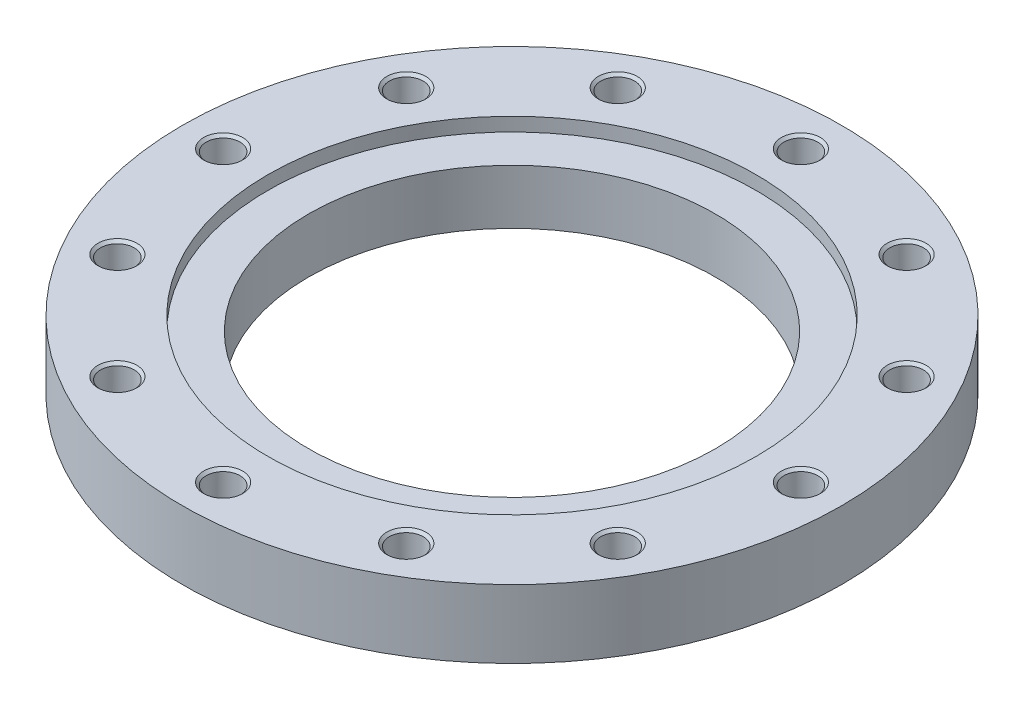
ISO-10303-21;
HEADER;
FILE_DESCRIPTION(('STEP AP214'),'2;1');
FILE_NAME('part.step','',(''),(''),'','','');
FILE_SCHEMA(('AUTOMOTIVE_DESIGN { 1 0 10303 214 1 1 1 1 }'));
ENDSEC;
DATA;
#1=APPLICATION_CONTEXT('core data for automotive mechanical design processes');
#2=APPLICATION_PROTOCOL_DEFINITION('international standard','automotive_design',2000,#1);
#3=PRODUCT_CONTEXT('',#1,'mechanical');
#4=PRODUCT('Part','Part','',(#3));
#5=PRODUCT_RELATED_PRODUCT_CATEGORY('part','',(#4));
#6=PRODUCT_DEFINITION_FORMATION('','',#4);
#7=PRODUCT_DEFINITION_CONTEXT('part definition',#1,'design');
#8=PRODUCT_DEFINITION('design','',#6,#7);
#9=PRODUCT_DEFINITION_SHAPE('','',#8);
#10=(LENGTH_UNIT() NAMED_UNIT(*) SI_UNIT(.MILLI.,.METRE.));
#11=(NAMED_UNIT(*) PLANE_ANGLE_UNIT() SI_UNIT($,.RADIAN.));
#12=(NAMED_UNIT(*) SI_UNIT($,.STERADIAN.) SOLID_ANGLE_UNIT());
#13=UNCERTAINTY_MEASURE_WITH_UNIT(LENGTH_MEASURE(1.E-05),#10,'distance_accuracy_value','');
#14=(GEOMETRIC_REPRESENTATION_CONTEXT(3) GLOBAL_UNCERTAINTY_ASSIGNED_CONTEXT((#13)) GLOBAL_UNIT_ASSIGNED_CONTEXT((#10,
#11,#12)) REPRESENTATION_CONTEXT('',''));
#15=CARTESIAN_POINT('',(0.,0.,0.));
#16=DIRECTION('',(0.,0.,1.));
#17=DIRECTION('',(1.,0.,0.));
#18=AXIS2_PLACEMENT_3D('',#15,#16,#17);
#19=CARTESIAN_POINT('',(0.,21.,0.));
#20=DIRECTION('',(0.,-1.,0.));
#21=DIRECTION('',(1.,0.,0.));
#22=AXIS2_PLACEMENT_3D('',#19,#20,#21);
#23=CYLINDRICAL_SURFACE('',#22,202.5);
#24=CARTESIAN_POINT('',(0.,0.,0.));
#25=DIRECTION('',(0.,1.,0.));
#26=DIRECTION('',(1.,0.,0.));
#27=AXIS2_PLACEMENT_3D('',#24,#25,#26);
#28=CIRCLE('',#27,202.5);
#29=CARTESIAN_POINT('',(202.5,0.,0.));
#30=VERTEX_POINT('',#29);
#31=EDGE_CURVE('E10',#30,#30,#28,.T.);
#32=ORIENTED_EDGE('',*,*,#31,.T.);
#33=EDGE_LOOP('',(#32));
#34=FACE_BOUND('',#33,.T.);
#35=CARTESIAN_POINT('',(0.,42.,0.));
#36=DIRECTION('',(0.,1.,0.));
#37=DIRECTION('',(1.,0.,0.));
#38=AXIS2_PLACEMENT_3D('',#35,#36,#37);
#39=CIRCLE('',#38,202.5);
#40=CARTESIAN_POINT('',(202.5,42.,0.));
#41=VERTEX_POINT('',#40);
#42=EDGE_CURVE('E316',#41,#41,#39,.T.);
#43=ORIENTED_EDGE('',*,*,#42,.F.);
#44=EDGE_LOOP('',(#43));
#45=FACE_BOUND('',#44,.T.);
#46=ADVANCED_FACE('F16',(#34,#45),#23,.T.);
#47=CARTESIAN_POINT('',(163.75,0.,0.));
#48=DIRECTION('',(0.,-1.,0.));
#49=DIRECTION('',(-1.,0.,0.));
#50=AXIS2_PLACEMENT_3D('',#47,#48,#49);
#51=PLANE('',#50);
#52=CARTESIAN_POINT('',(0.,0.,0.));
#53=DIRECTION('',(0.,1.,0.));
#54=DIRECTION('',(1.,0.,0.));
#55=AXIS2_PLACEMENT_3D('',#52,#53,#54);
#56=CIRCLE('',#55,125.);
#57=CARTESIAN_POINT('',(125.,0.,0.));
#58=VERTEX_POINT('',#57);
#59=EDGE_CURVE('E24',#58,#58,#56,.T.);
#60=ORIENTED_EDGE('',*,*,#59,.T.);
#61=EDGE_LOOP('',(#60));
#62=FACE_BOUND('',#61,.T.);
#63=ORIENTED_EDGE('',*,*,#31,.F.);
#64=EDGE_LOOP('',(#63));
#65=FACE_BOUND('',#64,.T.);
#66=ADVANCED_FACE('F18',(#62,#65),#51,.T.);
#67=CARTESIAN_POINT('',(0.,21.,0.));
#68=DIRECTION('',(0.,-1.,0.));
#69=DIRECTION('',(1.,0.,0.));
#70=AXIS2_PLACEMENT_3D('',#67,#68,#69);
#71=CYLINDRICAL_SURFACE('',#70,125.);
#72=ORIENTED_EDGE('',*,*,#59,.F.);
#73=EDGE_LOOP('',(#72));
#74=FACE_BOUND('',#73,.T.);
#75=CARTESIAN_POINT('',(0.,33.6,0.));
#76=DIRECTION('',(0.,1.,0.));
#77=DIRECTION('',(1.,0.,0.));
#78=AXIS2_PLACEMENT_3D('',#75,#76,#77);
#79=CIRCLE('',#78,125.);
#80=CARTESIAN_POINT('',(-125.,33.6,0.));
#81=VERTEX_POINT('',#80);
#82=EDGE_CURVE('E314',#81,#81,#79,.T.);
#83=ORIENTED_EDGE('',*,*,#82,.T.);
#84=EDGE_LOOP('',(#83));
#85=FACE_BOUND('',#84,.T.);
#86=ADVANCED_FACE('F478',(#74,#85),#71,.F.);
#87=CARTESIAN_POINT('',(163.75,42.,0.));
#88=DIRECTION('',(0.,1.,0.));
#89=DIRECTION('',(1.,0.,0.));
#90=AXIS2_PLACEMENT_3D('',#87,#88,#89);
#91=PLANE('',#90);
#92=ORIENTED_EDGE('',*,*,#42,.T.);
#93=EDGE_LOOP('',(#92));
#94=FACE_BOUND('',#93,.T.);
#95=CARTESIAN_POINT('',(0.,42.,0.));
#96=DIRECTION('',(0.,-1.,0.));
#97=DIRECTION('',(1.,0.,0.));
#98=AXIS2_PLACEMENT_3D('',#95,#96,#97);
#99=CIRCLE('',#98,150.);
#100=CARTESIAN_POINT('',(-150.,42.,0.));
#101=VERTEX_POINT('',#100);
#102=EDGE_CURVE('E362',#101,#101,#99,.T.);
#103=ORIENTED_EDGE('',*,*,#102,.T.);
#104=EDGE_LOOP('',(#103));
#105=FACE_BOUND('',#104,.T.);
#106=CARTESIAN_POINT('',(177.5,42.,0.));
#107=DIRECTION('',(0.,-1.,0.));
#108=DIRECTION('',(1.,0.,0.));
#109=AXIS2_PLACEMENT_3D('',#106,#107,#108);
#110=CIRCLE('',#109,12.);
#111=CARTESIAN_POINT('',(189.5,42.,0.));
#112=VERTEX_POINT('',#111);
#113=EDGE_CURVE('E343',#112,#112,#110,.T.);
#114=ORIENTED_EDGE('',*,*,#113,.T.);
#115=EDGE_LOOP('',(#114));
#116=FACE_BOUND('',#115,.T.);
#117=CARTESIAN_POINT('',(153.719509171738,42.,-88.75));
#118=DIRECTION('',(0.,-1.,0.));
#119=DIRECTION('',(0.866025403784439,0.,-0.5));
#120=AXIS2_PLACEMENT_3D('',#117,#118,#119);
#121=CIRCLE('',#120,12.);
#122=CARTESIAN_POINT('',(164.111814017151,42.,-94.75));
#123=VERTEX_POINT('',#122);
#124=EDGE_CURVE('E434',#123,#123,#121,.T.);
#125=ORIENTED_EDGE('',*,*,#124,.T.);
#126=EDGE_LOOP('',(#125));
#127=FACE_BOUND('',#126,.T.);
#128=CARTESIAN_POINT('',(88.75,42.,-153.719509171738));
#129=DIRECTION('',(0.,-1.,0.));
#130=DIRECTION('',(0.5,0.,-0.866025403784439));
#131=AXIS2_PLACEMENT_3D('',#128,#129,#130);
#132=CIRCLE('',#131,12.);
#133=CARTESIAN_POINT('',(94.75,42.,-164.111814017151));
#134=VERTEX_POINT('',#133);
#135=EDGE_CURVE('E422',#134,#134,#132,.T.);
#136=ORIENTED_EDGE('',*,*,#135,.T.);
#137=EDGE_LOOP('',(#136));
#138=FACE_BOUND('',#137,.T.);
#139=CARTESIAN_POINT('',(0.,42.,-177.5));
#140=DIRECTION('',(0.,-1.,0.));
#141=DIRECTION('',(0.,0.,-1.));
#142=AXIS2_PLACEMENT_3D('',#139,#140,#141);
#143=CIRCLE('',#142,12.);
#144=CARTESIAN_POINT('',(0.,42.,-189.5));
#145=VERTEX_POINT('',#144);
#146=EDGE_CURVE('E389',#145,#145,#143,.T.);
#147=ORIENTED_EDGE('',*,*,#146,.T.);
#148=EDGE_LOOP('',(#147));
#149=FACE_BOUND('',#148,.T.);
#150=CARTESIAN_POINT('',(-88.75,42.,-153.719509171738));
#151=DIRECTION('',(0.,-1.,0.));
#152=DIRECTION('',(-0.5,0.,-0.866025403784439));
#153=AXIS2_PLACEMENT_3D('',#150,#151,#152);
#154=CIRCLE('',#153,12.);
#155=CARTESIAN_POINT('',(-94.75,42.,-164.111814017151));
#156=VERTEX_POINT('',#155);
#157=EDGE_CURVE('E327',#156,#156,#154,.T.);
#158=ORIENTED_EDGE('',*,*,#157,.T.);
#159=EDGE_LOOP('',(#158));
#160=FACE_BOUND('',#159,.T.);
#161=CARTESIAN_POINT('',(-153.719509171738,42.,-88.75));
#162=DIRECTION('',(0.,-1.,0.));
#163=DIRECTION('',(-0.866025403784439,0.,-0.5));
#164=AXIS2_PLACEMENT_3D('',#161,#162,#163);
#165=CIRCLE('',#164,12.);
#166=CARTESIAN_POINT('',(-164.111814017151,42.,-94.75));
#167=VERTEX_POINT('',#166);
#168=EDGE_CURVE('E358',#167,#167,#165,.T.);
#169=ORIENTED_EDGE('',*,*,#168,.T.);
#170=EDGE_LOOP('',(#169));
#171=FACE_BOUND('',#170,.T.);
#172=CARTESIAN_POINT('',(-177.5,42.,0.));
#173=DIRECTION('',(0.,-1.,0.));
#174=DIRECTION('',(-1.,0.,0.));
#175=AXIS2_PLACEMENT_3D('',#172,#173,#174);
#176=CIRCLE('',#175,12.);
#177=CARTESIAN_POINT('',(-189.5,42.,0.));
#178=VERTEX_POINT('',#177);
#179=EDGE_CURVE('E388',#178,#178,#176,.T.);
#180=ORIENTED_EDGE('',*,*,#179,.T.);
#181=EDGE_LOOP('',(#180));
#182=FACE_BOUND('',#181,.T.);
#183=CARTESIAN_POINT('',(-153.719509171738,42.,88.75));
#184=DIRECTION('',(0.,-1.,0.));
#185=DIRECTION('',(-0.866025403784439,0.,0.5));
#186=AXIS2_PLACEMENT_3D('',#183,#184,#185);
#187=CIRCLE('',#186,12.);
#188=CARTESIAN_POINT('',(-164.111814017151,42.,94.75));
#189=VERTEX_POINT('',#188);
#190=EDGE_CURVE('E372',#189,#189,#187,.T.);
#191=ORIENTED_EDGE('',*,*,#190,.T.);
#192=EDGE_LOOP('',(#191));
#193=FACE_BOUND('',#192,.T.);
#194=CARTESIAN_POINT('',(-88.75,42.,153.719509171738));
#195=DIRECTION('',(0.,-1.,0.));
#196=DIRECTION('',(-0.5,0.,0.866025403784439));
#197=AXIS2_PLACEMENT_3D('',#194,#195,#196);
#198=CIRCLE('',#197,12.);
#199=CARTESIAN_POINT('',(-94.75,42.,164.111814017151));
#200=VERTEX_POINT('',#199);
#201=EDGE_CURVE('E352',#200,#200,#198,.T.);
#202=ORIENTED_EDGE('',*,*,#201,.T.);
#203=EDGE_LOOP('',(#202));
#204=FACE_BOUND('',#203,.T.);
#205=CARTESIAN_POINT('',(0.,42.,177.5));
#206=DIRECTION('',(0.,-1.,0.));
#207=DIRECTION('',(0.,0.,1.));
#208=AXIS2_PLACEMENT_3D('',#205,#206,#207);
#209=CIRCLE('',#208,12.);
#210=CARTESIAN_POINT('',(0.,42.,189.5));
#211=VERTEX_POINT('',#210);
#212=EDGE_CURVE('E320',#211,#211,#209,.T.);
#213=ORIENTED_EDGE('',*,*,#212,.T.);
#214=EDGE_LOOP('',(#213));
#215=FACE_BOUND('',#214,.T.);
#216=CARTESIAN_POINT('',(88.75,42.,153.719509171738));
#217=DIRECTION('',(0.,-1.,0.));
#218=DIRECTION('',(0.5,0.,0.866025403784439));
#219=AXIS2_PLACEMENT_3D('',#216,#217,#218);
#220=CIRCLE('',#219,12.);
#221=CARTESIAN_POINT('',(94.75,42.,164.111814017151));
#222=VERTEX_POINT('',#221);
#223=EDGE_CURVE('E297',#222,#222,#220,.T.);
#224=ORIENTED_EDGE('',*,*,#223,.T.);
#225=EDGE_LOOP('',(#224));
#226=FACE_BOUND('',#225,.T.);
#227=CARTESIAN_POINT('',(153.719509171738,42.,88.75));
#228=DIRECTION('',(0.,-1.,0.));
#229=DIRECTION('',(0.866025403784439,0.,0.5));
#230=AXIS2_PLACEMENT_3D('',#227,#228,#229);
#231=CIRCLE('',#230,12.);
#232=CARTESIAN_POINT('',(164.111814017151,42.,94.75));
#233=VERTEX_POINT('',#232);
#234=EDGE_CURVE('E313',#233,#233,#231,.T.);
#235=ORIENTED_EDGE('',*,*,#234,.T.);
#236=EDGE_LOOP('',(#235));
#237=FACE_BOUND('',#236,.T.);
#238=ADVANCED_FACE('F298',(#94,#105,#116,#127,#138,#149,#160,#171,#182,#193,#204,#215,#226,
#237),#91,.T.);
#239=CARTESIAN_POINT('',(0.,33.6,0.));
#240=DIRECTION('',(0.,-1.,0.));
#241=DIRECTION('',(-1.,0.,0.));
#242=AXIS2_PLACEMENT_3D('',#239,#240,#241);
#243=PLANE('',#242);
#244=CARTESIAN_POINT('',(0.,33.6,0.));
#245=DIRECTION('',(0.,-1.,0.));
#246=DIRECTION('',(1.,0.,0.));
#247=AXIS2_PLACEMENT_3D('',#244,#245,#246);
#248=CIRCLE('',#247,150.);
#249=CARTESIAN_POINT('',(150.,33.6,0.));
#250=VERTEX_POINT('',#249);
#251=EDGE_CURVE('E317',#250,#250,#248,.T.);
#252=ORIENTED_EDGE('',*,*,#251,.F.);
#253=EDGE_LOOP('',(#252));
#254=FACE_BOUND('',#253,.T.);
#255=ORIENTED_EDGE('',*,*,#82,.F.);
#256=EDGE_LOOP('',(#255));
#257=FACE_BOUND('',#256,.T.);
#258=ADVANCED_FACE('F459',(#254,#257),#243,.F.);
#259=CARTESIAN_POINT('',(0.,39.9,0.));
#260=DIRECTION('',(0.,-1.,0.));
#261=DIRECTION('',(1.,0.,0.));
#262=AXIS2_PLACEMENT_3D('',#259,#260,#261);
#263=CYLINDRICAL_SURFACE('',#262,150.);
#264=ORIENTED_EDGE('',*,*,#251,.T.);
#265=EDGE_LOOP('',(#264));
#266=FACE_BOUND('',#265,.T.);
#267=ORIENTED_EDGE('',*,*,#102,.F.);
#268=EDGE_LOOP('',(#267));
#269=FACE_BOUND('',#268,.T.);
#270=ADVANCED_FACE('F456',(#266,#269),#263,.F.);
#271=CARTESIAN_POINT('',(177.5,6.00463463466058,0.));
#272=DIRECTION('',(0.,1.,0.));
#273=DIRECTION('',(1.,0.,0.));
#274=AXIS2_PLACEMENT_3D('',#271,#272,#273);
#275=CONICAL_SURFACE('',#274,5.188125,1.0471975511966);
#276=CARTESIAN_POINT('',(177.5,9.,0.));
#277=DIRECTION('',(0.,-1.,0.));
#278=DIRECTION('',(1.,0.,0.));
#279=AXIS2_PLACEMENT_3D('',#276,#277,#278);
#280=CIRCLE('',#279,10.37625);
#281=CARTESIAN_POINT('',(187.87625,9.,0.));
#282=VERTEX_POINT('',#281);
#283=EDGE_CURVE('E450',#282,#282,#280,.T.);
#284=ORIENTED_EDGE('',*,*,#283,.F.);
#285=EDGE_LOOP('',(#284));
#286=FACE_BOUND('',#285,.T.);
#287=CARTESIAN_POINT('',(177.5,3.00926926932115,0.));
#288=VERTEX_POINT('',#287);
#289=VERTEX_LOOP('',#288);
#290=FACE_BOUND('',#289,.T.);
#291=ADVANCED_FACE('F458',(#286,#290),#275,.F.);
#292=CARTESIAN_POINT('',(177.5,12.688125,0.));
#293=DIRECTION('',(0.,1.,0.));
#294=DIRECTION('',(1.,0.,0.));
#295=AXIS2_PLACEMENT_3D('',#292,#293,#294);
#296=CYLINDRICAL_SURFACE('',#295,10.37625);
#297=CARTESIAN_POINT('',(177.5,16.37625,0.));
#298=DIRECTION('',(0.,-1.,0.));
#299=DIRECTION('',(1.,0.,0.));
#300=AXIS2_PLACEMENT_3D('',#297,#298,#299);
#301=CIRCLE('',#300,10.37625);
#302=CARTESIAN_POINT('',(187.87625,16.37625,0.));
#303=VERTEX_POINT('',#302);
#304=EDGE_CURVE('E448',#303,#303,#301,.T.);
#305=ORIENTED_EDGE('',*,*,#304,.F.);
#306=EDGE_LOOP('',(#305));
#307=FACE_BOUND('',#306,.T.);
#308=ORIENTED_EDGE('',*,*,#283,.T.);
#309=EDGE_LOOP('',(#308));
#310=FACE_BOUND('',#309,.T.);
#311=ADVANCED_FACE('F467',(#307,#310),#296,.F.);
#312=CARTESIAN_POINT('',(177.5,17.188125,0.));
#313=DIRECTION('',(0.,1.,0.));
#314=DIRECTION('',(1.,0.,0.));
#315=AXIS2_PLACEMENT_3D('',#312,#313,#314);
#316=CONICAL_SURFACE('',#315,11.188125,0.785398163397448);
#317=CARTESIAN_POINT('',(177.5,18.,0.));
#318=DIRECTION('',(0.,-1.,0.));
#319=DIRECTION('',(1.,0.,0.));
#320=AXIS2_PLACEMENT_3D('',#317,#318,#319);
#321=CIRCLE('',#320,12.);
#322=CARTESIAN_POINT('',(189.5,18.,0.));
#323=VERTEX_POINT('',#322);
#324=EDGE_CURVE('E446',#323,#323,#321,.T.);
#325=ORIENTED_EDGE('',*,*,#324,.F.);
#326=EDGE_LOOP('',(#325));
#327=FACE_BOUND('',#326,.T.);
#328=ORIENTED_EDGE('',*,*,#304,.T.);
#329=EDGE_LOOP('',(#328));
#330=FACE_BOUND('',#329,.T.);
#331=ADVANCED_FACE('F609',(#327,#330),#316,.F.);
#332=CARTESIAN_POINT('',(188.688125,18.,0.));
#333=DIRECTION('',(0.,1.,0.));
#334=DIRECTION('',(-1.,0.,0.));
#335=AXIS2_PLACEMENT_3D('',#332,#333,#334);
#336=PLANE('',#335);
#337=CARTESIAN_POINT('',(177.5,18.,0.));
#338=DIRECTION('',(0.,-1.,0.));
#339=DIRECTION('',(1.,0.,0.));
#340=AXIS2_PLACEMENT_3D('',#337,#338,#339);
#341=CIRCLE('',#340,10.37625);
#342=CARTESIAN_POINT('',(187.87625,18.,0.));
#343=VERTEX_POINT('',#342);
#344=EDGE_CURVE('E444',#343,#343,#341,.T.);
#345=ORIENTED_EDGE('',*,*,#344,.F.);
#346=EDGE_LOOP('',(#345));
#347=FACE_BOUND('',#346,.T.);
#348=ORIENTED_EDGE('',*,*,#324,.T.);
#349=EDGE_LOOP('',(#348));
#350=FACE_BOUND('',#349,.T.);
#351=ADVANCED_FACE('F605',(#347,#350),#336,.F.);
#352=CARTESIAN_POINT('',(177.5,29.188125,0.));
#353=DIRECTION('',(0.,1.,0.));
#354=DIRECTION('',(1.,0.,0.));
#355=AXIS2_PLACEMENT_3D('',#352,#353,#354);
#356=CYLINDRICAL_SURFACE('',#355,10.37625);
#357=CARTESIAN_POINT('',(177.5,40.37625,0.));
#358=DIRECTION('',(0.,-1.,0.));
#359=DIRECTION('',(1.,0.,0.));
#360=AXIS2_PLACEMENT_3D('',#357,#358,#359);
#361=CIRCLE('',#360,10.37625);
#362=CARTESIAN_POINT('',(187.87625,40.37625,0.));
#363=VERTEX_POINT('',#362);
#364=EDGE_CURVE('E341',#363,#363,#361,.T.);
#365=ORIENTED_EDGE('',*,*,#364,.F.);
#366=EDGE_LOOP('',(#365));
#367=FACE_BOUND('',#366,.T.);
#368=ORIENTED_EDGE('',*,*,#344,.T.);
#369=EDGE_LOOP('',(#368));
#370=FACE_BOUND('',#369,.T.);
#371=ADVANCED_FACE('F602',(#367,#370),#356,.F.);
#372=CARTESIAN_POINT('',(177.5,41.188125,0.));
#373=DIRECTION('',(0.,1.,0.));
#374=DIRECTION('',(1.,0.,0.));
#375=AXIS2_PLACEMENT_3D('',#372,#373,#374);
#376=CONICAL_SURFACE('',#375,11.188125,0.785398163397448);
#377=ORIENTED_EDGE('',*,*,#113,.F.);
#378=EDGE_LOOP('',(#377));
#379=FACE_BOUND('',#378,.T.);
#380=ORIENTED_EDGE('',*,*,#364,.T.);
#381=EDGE_LOOP('',(#380));
#382=FACE_BOUND('',#381,.T.);
#383=ADVANCED_FACE('F600',(#379,#382),#376,.F.);
#384=CARTESIAN_POINT('',(153.719509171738,6.00463463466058,-88.75));
#385=DIRECTION('',(0.,1.,0.));
#386=DIRECTION('',(0.866025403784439,0.,-0.5));
#387=AXIS2_PLACEMENT_3D('',#384,#385,#386);
#388=CONICAL_SURFACE('',#387,5.188125,1.0471975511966);
#389=CARTESIAN_POINT('',(153.719509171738,9.,-88.75));
#390=DIRECTION('',(0.,-1.,0.));
#391=DIRECTION('',(0.866025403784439,0.,-0.5));
#392=AXIS2_PLACEMENT_3D('',#389,#390,#391);
#393=CIRCLE('',#392,10.37625);
#394=CARTESIAN_POINT('',(162.705605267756,9.,-93.938125));
#395=VERTEX_POINT('',#394);
#396=EDGE_CURVE('E344',#395,#395,#393,.T.);
#397=ORIENTED_EDGE('',*,*,#396,.F.);
#398=EDGE_LOOP('',(#397));
#399=FACE_BOUND('',#398,.T.);
#400=CARTESIAN_POINT('',(153.719509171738,3.00926926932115,-88.75));
#401=VERTEX_POINT('',#400);
#402=VERTEX_LOOP('',#401);
#403=FACE_BOUND('',#402,.T.);
#404=ADVANCED_FACE('F596',(#399,#403),#388,.F.);
#405=CARTESIAN_POINT('',(153.719509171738,12.688125,-88.75));
#406=DIRECTION('',(0.,1.,0.));
#407=DIRECTION('',(0.866025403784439,0.,-0.5));
#408=AXIS2_PLACEMENT_3D('',#405,#406,#407);
#409=CYLINDRICAL_SURFACE('',#408,10.37625);
#410=CARTESIAN_POINT('',(153.719509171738,16.37625,-88.75));
#411=DIRECTION('',(0.,-1.,0.));
#412=DIRECTION('',(0.866025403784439,0.,-0.5));
#413=AXIS2_PLACEMENT_3D('',#410,#411,#412);
#414=CIRCLE('',#413,10.37625);
#415=CARTESIAN_POINT('',(162.705605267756,16.37625,-93.938125));
#416=VERTEX_POINT('',#415);
#417=EDGE_CURVE('E440',#416,#416,#414,.T.);
#418=ORIENTED_EDGE('',*,*,#417,.F.);
#419=EDGE_LOOP('',(#418));
#420=FACE_BOUND('',#419,.T.);
#421=ORIENTED_EDGE('',*,*,#396,.T.);
#422=EDGE_LOOP('',(#421));
#423=FACE_BOUND('',#422,.T.);
#424=ADVANCED_FACE('F592',(#420,#423),#409,.F.);
#425=CARTESIAN_POINT('',(153.719509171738,17.188125,-88.75));
#426=DIRECTION('',(0.,1.,0.));
#427=DIRECTION('',(0.866025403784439,0.,-0.5));
#428=AXIS2_PLACEMENT_3D('',#425,#426,#427);
#429=CONICAL_SURFACE('',#428,11.188125,0.785398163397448);
#430=CARTESIAN_POINT('',(153.719509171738,18.,-88.75));
#431=DIRECTION('',(0.,-1.,0.));
#432=DIRECTION('',(0.866025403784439,0.,-0.5));
#433=AXIS2_PLACEMENT_3D('',#430,#431,#432);
#434=CIRCLE('',#433,12.);
#435=CARTESIAN_POINT('',(164.111814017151,18.,-94.75));
#436=VERTEX_POINT('',#435);
#437=EDGE_CURVE('E438',#436,#436,#434,.T.);
#438=ORIENTED_EDGE('',*,*,#437,.F.);
#439=EDGE_LOOP('',(#438));
#440=FACE_BOUND('',#439,.T.);
#441=ORIENTED_EDGE('',*,*,#417,.T.);
#442=EDGE_LOOP('',(#441));
#443=FACE_BOUND('',#442,.T.);
#444=ADVANCED_FACE('F588',(#440,#443),#429,.F.);
#445=CARTESIAN_POINT('',(163.408709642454,18.,-94.3440625));
#446=DIRECTION('',(0.,1.,0.));
#447=DIRECTION('',(-0.866025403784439,0.,0.5));
#448=AXIS2_PLACEMENT_3D('',#445,#446,#447);
#449=PLANE('',#448);
#450=CARTESIAN_POINT('',(153.719509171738,18.,-88.75));
#451=DIRECTION('',(0.,-1.,0.));
#452=DIRECTION('',(0.866025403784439,0.,-0.5));
#453=AXIS2_PLACEMENT_3D('',#450,#451,#452);
#454=CIRCLE('',#453,10.37625);
#455=CARTESIAN_POINT('',(162.705605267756,18.,-93.938125));
#456=VERTEX_POINT('',#455);
#457=EDGE_CURVE('E436',#456,#456,#454,.T.);
#458=ORIENTED_EDGE('',*,*,#457,.F.);
#459=EDGE_LOOP('',(#458));
#460=FACE_BOUND('',#459,.T.);
#461=ORIENTED_EDGE('',*,*,#437,.T.);
#462=EDGE_LOOP('',(#461));
#463=FACE_BOUND('',#462,.T.);
#464=ADVANCED_FACE('F584',(#460,#463),#449,.F.);
#465=CARTESIAN_POINT('',(153.719509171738,29.188125,-88.75));
#466=DIRECTION('',(0.,1.,0.));
#467=DIRECTION('',(0.866025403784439,0.,-0.5));
#468=AXIS2_PLACEMENT_3D('',#465,#466,#467);
#469=CYLINDRICAL_SURFACE('',#468,10.37625);
#470=CARTESIAN_POINT('',(153.719509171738,40.37625,-88.75));
#471=DIRECTION('',(0.,-1.,0.));
#472=DIRECTION('',(0.866025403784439,0.,-0.5));
#473=AXIS2_PLACEMENT_3D('',#470,#471,#472);
#474=CIRCLE('',#473,10.37625);
#475=CARTESIAN_POINT('',(162.705605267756,40.37625,-93.938125));
#476=VERTEX_POINT('',#475);
#477=EDGE_CURVE('E432',#476,#476,#474,.T.);
#478=ORIENTED_EDGE('',*,*,#477,.F.);
#479=EDGE_LOOP('',(#478));
#480=FACE_BOUND('',#479,.T.);
#481=ORIENTED_EDGE('',*,*,#457,.T.);
#482=EDGE_LOOP('',(#481));
#483=FACE_BOUND('',#482,.T.);
#484=ADVANCED_FACE('F578',(#480,#483),#469,.F.);
#485=CARTESIAN_POINT('',(153.719509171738,41.188125,-88.75));
#486=DIRECTION('',(0.,1.,0.));
#487=DIRECTION('',(0.866025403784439,0.,-0.5));
#488=AXIS2_PLACEMENT_3D('',#485,#486,#487);
#489=CONICAL_SURFACE('',#488,11.188125,0.785398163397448);
#490=ORIENTED_EDGE('',*,*,#124,.F.);
#491=EDGE_LOOP('',(#490));
#492=FACE_BOUND('',#491,.T.);
#493=ORIENTED_EDGE('',*,*,#477,.T.);
#494=EDGE_LOOP('',(#493));
#495=FACE_BOUND('',#494,.T.);
#496=ADVANCED_FACE('F573',(#492,#495),#489,.F.);
#497=CARTESIAN_POINT('',(88.75,6.00463463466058,-153.719509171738));
#498=DIRECTION('',(0.,1.,0.));
#499=DIRECTION('',(0.5,0.,-0.866025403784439));
#500=AXIS2_PLACEMENT_3D('',#497,#498,#499);
#501=CONICAL_SURFACE('',#500,5.188125,1.0471975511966);
#502=CARTESIAN_POINT('',(88.75,9.,-153.719509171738));
#503=DIRECTION('',(0.,-1.,0.));
#504=DIRECTION('',(0.5,0.,-0.866025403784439));
#505=AXIS2_PLACEMENT_3D('',#502,#503,#504);
#506=CIRCLE('',#505,10.37625);
#507=CARTESIAN_POINT('',(93.938125,9.,-162.705605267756));
#508=VERTEX_POINT('',#507);
#509=EDGE_CURVE('E430',#508,#508,#506,.T.);
#510=ORIENTED_EDGE('',*,*,#509,.F.);
#511=EDGE_LOOP('',(#510));
#512=FACE_BOUND('',#511,.T.);
#513=CARTESIAN_POINT('',(88.75,3.00926926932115,-153.719509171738));
#514=VERTEX_POINT('',#513);
#515=VERTEX_LOOP('',#514);
#516=FACE_BOUND('',#515,.T.);
#517=ADVANCED_FACE('F567',(#512,#516),#501,.F.);
#518=CARTESIAN_POINT('',(88.75,12.688125,-153.719509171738));
#519=DIRECTION('',(0.,1.,0.));
#520=DIRECTION('',(0.5,0.,-0.866025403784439));
#521=AXIS2_PLACEMENT_3D('',#518,#519,#520);
#522=CYLINDRICAL_SURFACE('',#521,10.37625);
#523=CARTESIAN_POINT('',(88.75,16.37625,-153.719509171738));
#524=DIRECTION('',(0.,-1.,0.));
#525=DIRECTION('',(0.5,0.,-0.866025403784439));
#526=AXIS2_PLACEMENT_3D('',#523,#524,#525);
#527=CIRCLE('',#526,10.37625);
#528=CARTESIAN_POINT('',(93.938125,16.37625,-162.705605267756));
#529=VERTEX_POINT('',#528);
#530=EDGE_CURVE('E428',#529,#529,#527,.T.);
#531=ORIENTED_EDGE('',*,*,#530,.F.);
#532=EDGE_LOOP('',(#531));
#533=FACE_BOUND('',#532,.T.);
#534=ORIENTED_EDGE('',*,*,#509,.T.);
#535=EDGE_LOOP('',(#534));
#536=FACE_BOUND('',#535,.T.);
#537=ADVANCED_FACE('F561',(#533,#536),#522,.F.);
#538=CARTESIAN_POINT('',(88.75,17.188125,-153.719509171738));
#539=DIRECTION('',(0.,1.,0.));
#540=DIRECTION('',(0.5,0.,-0.866025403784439));
#541=AXIS2_PLACEMENT_3D('',#538,#539,#540);
#542=CONICAL_SURFACE('',#541,11.188125,0.785398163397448);
#543=CARTESIAN_POINT('',(88.75,18.,-153.719509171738));
#544=DIRECTION('',(0.,-1.,0.));
#545=DIRECTION('',(0.5,0.,-0.866025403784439));
#546=AXIS2_PLACEMENT_3D('',#543,#544,#545);
#547=CIRCLE('',#546,12.);
#548=CARTESIAN_POINT('',(94.75,18.,-164.111814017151));
#549=VERTEX_POINT('',#548);
#550=EDGE_CURVE('E426',#549,#549,#547,.T.);
#551=ORIENTED_EDGE('',*,*,#550,.F.);
#552=EDGE_LOOP('',(#551));
#553=FACE_BOUND('',#552,.T.);
#554=ORIENTED_EDGE('',*,*,#530,.T.);
#555=EDGE_LOOP('',(#554));
#556=FACE_BOUND('',#555,.T.);
#557=ADVANCED_FACE('F551',(#553,#556),#542,.F.);
#558=CARTESIAN_POINT('',(94.3440625,18.,-163.408709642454));
#559=DIRECTION('',(0.,1.,0.));
#560=DIRECTION('',(-0.5,0.,0.866025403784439));
#561=AXIS2_PLACEMENT_3D('',#558,#559,#560);
#562=PLANE('',#561);
#563=CARTESIAN_POINT('',(88.75,18.,-153.719509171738));
#564=DIRECTION('',(0.,-1.,0.));
#565=DIRECTION('',(0.5,0.,-0.866025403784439));
#566=AXIS2_PLACEMENT_3D('',#563,#564,#565);
#567=CIRCLE('',#566,10.37625);
#568=CARTESIAN_POINT('',(93.938125,18.,-162.705605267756));
#569=VERTEX_POINT('',#568);
#570=EDGE_CURVE('E424',#569,#569,#567,.T.);
#571=ORIENTED_EDGE('',*,*,#570,.F.);
#572=EDGE_LOOP('',(#571));
#573=FACE_BOUND('',#572,.T.);
#574=ORIENTED_EDGE('',*,*,#550,.T.);
#575=EDGE_LOOP('',(#574));
#576=FACE_BOUND('',#575,.T.);
#577=ADVANCED_FACE('F546',(#573,#576),#562,.F.);
#578=CARTESIAN_POINT('',(88.75,29.188125,-153.719509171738));
#579=DIRECTION('',(0.,1.,0.));
#580=DIRECTION('',(0.5,0.,-0.866025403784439));
#581=AXIS2_PLACEMENT_3D('',#578,#579,#580);
#582=CYLINDRICAL_SURFACE('',#581,10.37625);
#583=CARTESIAN_POINT('',(88.75,40.37625,-153.719509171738));
#584=DIRECTION('',(0.,-1.,0.));
#585=DIRECTION('',(0.5,0.,-0.866025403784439));
#586=AXIS2_PLACEMENT_3D('',#583,#584,#585);
#587=CIRCLE('',#586,10.37625);
#588=CARTESIAN_POINT('',(93.938125,40.37625,-162.705605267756));
#589=VERTEX_POINT('',#588);
#590=EDGE_CURVE('E398',#589,#589,#587,.T.);
#591=ORIENTED_EDGE('',*,*,#590,.F.);
#592=EDGE_LOOP('',(#591));
#593=FACE_BOUND('',#592,.T.);
#594=ORIENTED_EDGE('',*,*,#570,.T.);
#595=EDGE_LOOP('',(#594));
#596=FACE_BOUND('',#595,.T.);
#597=ADVANCED_FACE('F543',(#593,#596),#582,.F.);
#598=CARTESIAN_POINT('',(88.75,41.188125,-153.719509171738));
#599=DIRECTION('',(0.,1.,0.));
#600=DIRECTION('',(0.5,0.,-0.866025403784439));
#601=AXIS2_PLACEMENT_3D('',#598,#599,#600);
#602=CONICAL_SURFACE('',#601,11.188125,0.785398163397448);
#603=ORIENTED_EDGE('',*,*,#135,.F.);
#604=EDGE_LOOP('',(#603));
#605=FACE_BOUND('',#604,.T.);
#606=ORIENTED_EDGE('',*,*,#590,.T.);
#607=EDGE_LOOP('',(#606));
#608=FACE_BOUND('',#607,.T.);
#609=ADVANCED_FACE('F540',(#605,#608),#602,.F.);
#610=CARTESIAN_POINT('',(0.,6.00463463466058,-177.5));
#611=DIRECTION('',(0.,1.,0.));
#612=DIRECTION('',(0.,0.,-1.));
#613=AXIS2_PLACEMENT_3D('',#610,#611,#612);
#614=CONICAL_SURFACE('',#613,5.188125,1.0471975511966);
#615=CARTESIAN_POINT('',(0.,9.,-177.5));
#616=DIRECTION('',(0.,-1.,0.));
#617=DIRECTION('',(0.,0.,-1.));
#618=AXIS2_PLACEMENT_3D('',#615,#616,#617);
#619=CIRCLE('',#618,10.37625);
#620=CARTESIAN_POINT('',(0.,9.,-187.87625));
#621=VERTEX_POINT('',#620);
#622=EDGE_CURVE('E396',#621,#621,#619,.T.);
#623=ORIENTED_EDGE('',*,*,#622,.F.);
#624=EDGE_LOOP('',(#623));
#625=FACE_BOUND('',#624,.T.);
#626=CARTESIAN_POINT('',(0.,3.00926926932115,-177.5));
#627=VERTEX_POINT('',#626);
#628=VERTEX_LOOP('',#627);
#629=FACE_BOUND('',#628,.T.);
#630=ADVANCED_FACE('F542',(#625,#629),#614,.F.);
#631=CARTESIAN_POINT('',(0.,12.688125,-177.5));
#632=DIRECTION('',(0.,1.,0.));
#633=DIRECTION('',(0.,0.,-1.));
#634=AXIS2_PLACEMENT_3D('',#631,#632,#633);
#635=CYLINDRICAL_SURFACE('',#634,10.37625);
#636=CARTESIAN_POINT('',(0.,16.37625,-177.5));
#637=DIRECTION('',(0.,-1.,0.));
#638=DIRECTION('',(0.,0.,-1.));
#639=AXIS2_PLACEMENT_3D('',#636,#637,#638);
#640=CIRCLE('',#639,10.37625);
#641=CARTESIAN_POINT('',(0.,16.37625,-187.87625));
#642=VERTEX_POINT('',#641);
#643=EDGE_CURVE('E399',#642,#642,#640,.T.);
#644=ORIENTED_EDGE('',*,*,#643,.F.);
#645=EDGE_LOOP('',(#644));
#646=FACE_BOUND('',#645,.T.);
#647=ORIENTED_EDGE('',*,*,#622,.T.);
#648=EDGE_LOOP('',(#647));
#649=FACE_BOUND('',#648,.T.);
#650=ADVANCED_FACE('F538',(#646,#649),#635,.F.);
#651=CARTESIAN_POINT('',(0.,17.188125,-177.5));
#652=DIRECTION('',(0.,1.,0.));
#653=DIRECTION('',(0.,0.,-1.));
#654=AXIS2_PLACEMENT_3D('',#651,#652,#653);
#655=CONICAL_SURFACE('',#654,11.188125,0.785398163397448);
#656=CARTESIAN_POINT('',(0.,18.,-177.5));
#657=DIRECTION('',(0.,-1.,0.));
#658=DIRECTION('',(0.,0.,-1.));
#659=AXIS2_PLACEMENT_3D('',#656,#657,#658);
#660=CIRCLE('',#659,12.);
#661=CARTESIAN_POINT('',(0.,18.,-189.5));
#662=VERTEX_POINT('',#661);
#663=EDGE_CURVE('E418',#662,#662,#660,.T.);
#664=ORIENTED_EDGE('',*,*,#663,.F.);
#665=EDGE_LOOP('',(#664));
#666=FACE_BOUND('',#665,.T.);
#667=ORIENTED_EDGE('',*,*,#643,.T.);
#668=EDGE_LOOP('',(#667));
#669=FACE_BOUND('',#668,.T.);
#670=ADVANCED_FACE('F534',(#666,#669),#655,.F.);
#671=CARTESIAN_POINT('',(0.,18.,-188.688125));
#672=DIRECTION('',(0.,1.,0.));
#673=DIRECTION('',(0.,0.,1.));
#674=AXIS2_PLACEMENT_3D('',#671,#672,#673);
#675=PLANE('',#674);
#676=CARTESIAN_POINT('',(0.,18.,-177.5));
#677=DIRECTION('',(0.,-1.,0.));
#678=DIRECTION('',(0.,0.,-1.));
#679=AXIS2_PLACEMENT_3D('',#676,#677,#678);
#680=CIRCLE('',#679,10.37625);
#681=CARTESIAN_POINT('',(0.,18.,-187.87625));
#682=VERTEX_POINT('',#681);
#683=EDGE_CURVE('E391',#682,#682,#680,.T.);
#684=ORIENTED_EDGE('',*,*,#683,.F.);
#685=EDGE_LOOP('',(#684));
#686=FACE_BOUND('',#685,.T.);
#687=ORIENTED_EDGE('',*,*,#663,.T.);
#688=EDGE_LOOP('',(#687));
#689=FACE_BOUND('',#688,.T.);
#690=ADVANCED_FACE('F530',(#686,#689),#675,.F.);
#691=CARTESIAN_POINT('',(0.,29.188125,-177.5));
#692=DIRECTION('',(0.,1.,0.));
#693=DIRECTION('',(0.,0.,-1.));
#694=AXIS2_PLACEMENT_3D('',#691,#692,#693);
#695=CYLINDRICAL_SURFACE('',#694,10.37625);
#696=CARTESIAN_POINT('',(0.,40.37625,-177.5));
#697=DIRECTION('',(0.,-1.,0.));
#698=DIRECTION('',(0.,0.,-1.));
#699=AXIS2_PLACEMENT_3D('',#696,#697,#698);
#700=CIRCLE('',#699,10.37625);
#701=CARTESIAN_POINT('',(0.,40.37625,-187.87625));
#702=VERTEX_POINT('',#701);
#703=EDGE_CURVE('E383',#702,#702,#700,.T.);
#704=ORIENTED_EDGE('',*,*,#703,.F.);
#705=EDGE_LOOP('',(#704));
#706=FACE_BOUND('',#705,.T.);
#707=ORIENTED_EDGE('',*,*,#683,.T.);
#708=EDGE_LOOP('',(#707));
#709=FACE_BOUND('',#708,.T.);
#710=ADVANCED_FACE('F527',(#706,#709),#695,.F.);
#711=CARTESIAN_POINT('',(0.,41.188125,-177.5));
#712=DIRECTION('',(0.,1.,0.));
#713=DIRECTION('',(0.,0.,-1.));
#714=AXIS2_PLACEMENT_3D('',#711,#712,#713);
#715=CONICAL_SURFACE('',#714,11.188125,0.785398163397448);
#716=ORIENTED_EDGE('',*,*,#146,.F.);
#717=EDGE_LOOP('',(#716));
#718=FACE_BOUND('',#717,.T.);
#719=ORIENTED_EDGE('',*,*,#703,.T.);
#720=EDGE_LOOP('',(#719));
#721=FACE_BOUND('',#720,.T.);
#722=ADVANCED_FACE('F525',(#718,#721),#715,.F.);
#723=CARTESIAN_POINT('',(-88.75,6.00463463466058,-153.719509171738));
#724=DIRECTION('',(0.,1.,0.));
#725=DIRECTION('',(-0.5,0.,-0.866025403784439));
#726=AXIS2_PLACEMENT_3D('',#723,#724,#725);
#727=CONICAL_SURFACE('',#726,5.188125,1.0471975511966);
#728=CARTESIAN_POINT('',(-88.75,9.,-153.719509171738));
#729=DIRECTION('',(0.,-1.,0.));
#730=DIRECTION('',(-0.5,0.,-0.866025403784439));
#731=AXIS2_PLACEMENT_3D('',#728,#729,#730);
#732=CIRCLE('',#731,10.37625);
#733=CARTESIAN_POINT('',(-93.938125,9.,-162.705605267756));
#734=VERTEX_POINT('',#733);
#735=EDGE_CURVE('E381',#734,#734,#732,.T.);
#736=ORIENTED_EDGE('',*,*,#735,.F.);
#737=EDGE_LOOP('',(#736));
#738=FACE_BOUND('',#737,.T.);
#739=CARTESIAN_POINT('',(-88.75,3.00926926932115,-153.719509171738));
#740=VERTEX_POINT('',#739);
#741=VERTEX_LOOP('',#740);
#742=FACE_BOUND('',#741,.T.);
#743=ADVANCED_FACE('F521',(#738,#742),#727,.F.);
#744=CARTESIAN_POINT('',(-88.75,12.688125,-153.719509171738));
#745=DIRECTION('',(0.,1.,0.));
#746=DIRECTION('',(-0.5,0.,-0.866025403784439));
#747=AXIS2_PLACEMENT_3D('',#744,#745,#746);
#748=CYLINDRICAL_SURFACE('',#747,10.37625);
#749=CARTESIAN_POINT('',(-88.75,16.37625,-153.719509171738));
#750=DIRECTION('',(0.,-1.,0.));
#751=DIRECTION('',(-0.5,0.,-0.866025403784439));
#752=AXIS2_PLACEMENT_3D('',#749,#750,#751);
#753=CIRCLE('',#752,10.37625);
#754=CARTESIAN_POINT('',(-93.938125,16.37625,-162.705605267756));
#755=VERTEX_POINT('',#754);
#756=EDGE_CURVE('E384',#755,#755,#753,.T.);
#757=ORIENTED_EDGE('',*,*,#756,.F.);
#758=EDGE_LOOP('',(#757));
#759=FACE_BOUND('',#758,.T.);
#760=ORIENTED_EDGE('',*,*,#735,.T.);
#761=EDGE_LOOP('',(#760));
#762=FACE_BOUND('',#761,.T.);
#763=ADVANCED_FACE('F517',(#759,#762),#748,.F.);
#764=CARTESIAN_POINT('',(-88.75,17.188125,-153.719509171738));
#765=DIRECTION('',(0.,1.,0.));
#766=DIRECTION('',(-0.5,0.,-0.866025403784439));
#767=AXIS2_PLACEMENT_3D('',#764,#765,#766);
#768=CONICAL_SURFACE('',#767,11.188125,0.785398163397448);
#769=CARTESIAN_POINT('',(-88.75,18.,-153.719509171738));
#770=DIRECTION('',(0.,-1.,0.));
#771=DIRECTION('',(-0.5,0.,-0.866025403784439));
#772=AXIS2_PLACEMENT_3D('',#769,#770,#771);
#773=CIRCLE('',#772,12.);
#774=CARTESIAN_POINT('',(-94.75,18.,-164.111814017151));
#775=VERTEX_POINT('',#774);
#776=EDGE_CURVE('E413',#775,#775,#773,.T.);
#777=ORIENTED_EDGE('',*,*,#776,.F.);
#778=EDGE_LOOP('',(#777));
#779=FACE_BOUND('',#778,.T.);
#780=ORIENTED_EDGE('',*,*,#756,.T.);
#781=EDGE_LOOP('',(#780));
#782=FACE_BOUND('',#781,.T.);
#783=ADVANCED_FACE('F513',(#779,#782),#768,.F.);
#784=CARTESIAN_POINT('',(-94.3440625,18.,-163.408709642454));
#785=DIRECTION('',(0.,1.,0.));
#786=DIRECTION('',(0.5,0.,0.866025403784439));
#787=AXIS2_PLACEMENT_3D('',#784,#785,#786);
#788=PLANE('',#787);
#789=CARTESIAN_POINT('',(-88.75,18.,-153.719509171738));
#790=DIRECTION('',(0.,-1.,0.));
#791=DIRECTION('',(-0.5,0.,-0.866025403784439));
#792=AXIS2_PLACEMENT_3D('',#789,#790,#791);
#793=CIRCLE('',#792,10.37625);
#794=CARTESIAN_POINT('',(-93.938125,18.,-162.705605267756));
#795=VERTEX_POINT('',#794);
#796=EDGE_CURVE('E328',#795,#795,#793,.T.);
#797=ORIENTED_EDGE('',*,*,#796,.F.);
#798=EDGE_LOOP('',(#797));
#799=FACE_BOUND('',#798,.T.);
#800=ORIENTED_EDGE('',*,*,#776,.T.);
#801=EDGE_LOOP('',(#800));
#802=FACE_BOUND('',#801,.T.);
#803=ADVANCED_FACE('F510',(#799,#802),#788,.F.);
#804=CARTESIAN_POINT('',(-88.75,29.188125,-153.719509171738));
#805=DIRECTION('',(0.,1.,0.));
#806=DIRECTION('',(-0.5,0.,-0.866025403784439));
#807=AXIS2_PLACEMENT_3D('',#804,#805,#806);
#808=CYLINDRICAL_SURFACE('',#807,10.37625);
#809=CARTESIAN_POINT('',(-88.75,40.37625,-153.719509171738));
#810=DIRECTION('',(0.,-1.,0.));
#811=DIRECTION('',(-0.5,0.,-0.866025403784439));
#812=AXIS2_PLACEMENT_3D('',#809,#810,#811);
#813=CIRCLE('',#812,10.37625);
#814=CARTESIAN_POINT('',(-93.938125,40.37625,-162.705605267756));
#815=VERTEX_POINT('',#814);
#816=EDGE_CURVE('E329',#815,#815,#813,.T.);
#817=ORIENTED_EDGE('',*,*,#816,.F.);
#818=EDGE_LOOP('',(#817));
#819=FACE_BOUND('',#818,.T.);
#820=ORIENTED_EDGE('',*,*,#796,.T.);
#821=EDGE_LOOP('',(#820));
#822=FACE_BOUND('',#821,.T.);
#823=ADVANCED_FACE('F508',(#819,#822),#808,.F.);
#824=CARTESIAN_POINT('',(-88.75,41.188125,-153.719509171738));
#825=DIRECTION('',(0.,1.,0.));
#826=DIRECTION('',(-0.5,0.,-0.866025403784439));
#827=AXIS2_PLACEMENT_3D('',#824,#825,#826);
#828=CONICAL_SURFACE('',#827,11.188125,0.785398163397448);
#829=ORIENTED_EDGE('',*,*,#157,.F.);
#830=EDGE_LOOP('',(#829));
#831=FACE_BOUND('',#830,.T.);
#832=ORIENTED_EDGE('',*,*,#816,.T.);
#833=EDGE_LOOP('',(#832));
#834=FACE_BOUND('',#833,.T.);
#835=ADVANCED_FACE('F504',(#831,#834),#828,.F.);
#836=CARTESIAN_POINT('',(-153.719509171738,6.00463463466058,-88.75));
#837=DIRECTION('',(0.,1.,0.));
#838=DIRECTION('',(-0.866025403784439,0.,-0.5));
#839=AXIS2_PLACEMENT_3D('',#836,#837,#838);
#840=CONICAL_SURFACE('',#839,5.188125,1.0471975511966);
#841=CARTESIAN_POINT('',(-153.719509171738,9.,-88.75));
#842=DIRECTION('',(0.,-1.,0.));
#843=DIRECTION('',(-0.866025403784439,0.,-0.5));
#844=AXIS2_PLACEMENT_3D('',#841,#842,#843);
#845=CIRCLE('',#844,10.37625);
#846=CARTESIAN_POINT('',(-162.705605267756,9.,-93.938125));
#847=VERTEX_POINT('',#846);
#848=EDGE_CURVE('E370',#847,#847,#845,.T.);
#849=ORIENTED_EDGE('',*,*,#848,.F.);
#850=EDGE_LOOP('',(#849));
#851=FACE_BOUND('',#850,.T.);
#852=CARTESIAN_POINT('',(-153.719509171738,3.00926926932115,-88.75));
#853=VERTEX_POINT('',#852);
#854=VERTEX_LOOP('',#853);
#855=FACE_BOUND('',#854,.T.);
#856=ADVANCED_FACE('F500',(#851,#855),#840,.F.);
#857=CARTESIAN_POINT('',(-153.719509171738,12.688125,-88.75));
#858=DIRECTION('',(0.,1.,0.));
#859=DIRECTION('',(-0.866025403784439,0.,-0.5));
#860=AXIS2_PLACEMENT_3D('',#857,#858,#859);
#861=CYLINDRICAL_SURFACE('',#860,10.37625);
#862=CARTESIAN_POINT('',(-153.719509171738,16.37625,-88.75));
#863=DIRECTION('',(0.,-1.,0.));
#864=DIRECTION('',(-0.866025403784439,0.,-0.5));
#865=AXIS2_PLACEMENT_3D('',#862,#863,#864);
#866=CIRCLE('',#865,10.37625);
#867=CARTESIAN_POINT('',(-162.705605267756,16.37625,-93.938125));
#868=VERTEX_POINT('',#867);
#869=EDGE_CURVE('E409',#868,#868,#866,.T.);
#870=ORIENTED_EDGE('',*,*,#869,.F.);
#871=EDGE_LOOP('',(#870));
#872=FACE_BOUND('',#871,.T.);
#873=ORIENTED_EDGE('',*,*,#848,.T.);
#874=EDGE_LOOP('',(#873));
#875=FACE_BOUND('',#874,.T.);
#876=ADVANCED_FACE('F497',(#872,#875),#861,.F.);
#877=CARTESIAN_POINT('',(-153.719509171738,17.188125,-88.75));
#878=DIRECTION('',(0.,1.,0.));
#879=DIRECTION('',(-0.866025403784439,0.,-0.5));
#880=AXIS2_PLACEMENT_3D('',#877,#878,#879);
#881=CONICAL_SURFACE('',#880,11.188125,0.785398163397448);
#882=CARTESIAN_POINT('',(-153.719509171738,18.,-88.75));
#883=DIRECTION('',(0.,-1.,0.));
#884=DIRECTION('',(-0.866025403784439,0.,-0.5));
#885=AXIS2_PLACEMENT_3D('',#882,#883,#884);
#886=CIRCLE('',#885,12.);
#887=CARTESIAN_POINT('',(-164.111814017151,18.,-94.75));
#888=VERTEX_POINT('',#887);
#889=EDGE_CURVE('E357',#888,#888,#886,.T.);
#890=ORIENTED_EDGE('',*,*,#889,.F.);
#891=EDGE_LOOP('',(#890));
#892=FACE_BOUND('',#891,.T.);
#893=ORIENTED_EDGE('',*,*,#869,.T.);
#894=EDGE_LOOP('',(#893));
#895=FACE_BOUND('',#894,.T.);
#896=ADVANCED_FACE('F495',(#892,#895),#881,.F.);
#897=CARTESIAN_POINT('',(-163.408709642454,18.,-94.3440625));
#898=DIRECTION('',(0.,1.,0.));
#899=DIRECTION('',(0.866025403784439,0.,0.5));
#900=AXIS2_PLACEMENT_3D('',#897,#898,#899);
#901=PLANE('',#900);
#902=CARTESIAN_POINT('',(-153.719509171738,18.,-88.75));
#903=DIRECTION('',(0.,-1.,0.));
#904=DIRECTION('',(-0.866025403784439,0.,-0.5));
#905=AXIS2_PLACEMENT_3D('',#902,#903,#904);
#906=CIRCLE('',#905,10.37625);
#907=CARTESIAN_POINT('',(-162.705605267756,18.,-93.938125));
#908=VERTEX_POINT('',#907);
#909=EDGE_CURVE('E355',#908,#908,#906,.T.);
#910=ORIENTED_EDGE('',*,*,#909,.F.);
#911=EDGE_LOOP('',(#910));
#912=FACE_BOUND('',#911,.T.);
#913=ORIENTED_EDGE('',*,*,#889,.T.);
#914=EDGE_LOOP('',(#913));
#915=FACE_BOUND('',#914,.T.);
#916=ADVANCED_FACE('F491',(#912,#915),#901,.F.);
#917=CARTESIAN_POINT('',(-153.719509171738,29.188125,-88.75));
#918=DIRECTION('',(0.,1.,0.));
#919=DIRECTION('',(-0.866025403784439,0.,-0.5));
#920=AXIS2_PLACEMENT_3D('',#917,#918,#919);
#921=CYLINDRICAL_SURFACE('',#920,10.37625);
#922=CARTESIAN_POINT('',(-153.719509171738,40.37625,-88.75));
#923=DIRECTION('',(0.,-1.,0.));
#924=DIRECTION('',(-0.866025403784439,0.,-0.5));
#925=AXIS2_PLACEMENT_3D('',#922,#923,#924);
#926=CIRCLE('',#925,10.37625);
#927=CARTESIAN_POINT('',(-162.705605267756,40.37625,-93.938125));
#928=VERTEX_POINT('',#927);
#929=EDGE_CURVE('E405',#928,#928,#926,.T.);
#930=ORIENTED_EDGE('',*,*,#929,.F.);
#931=EDGE_LOOP('',(#930));
#932=FACE_BOUND('',#931,.T.);
#933=ORIENTED_EDGE('',*,*,#909,.T.);
#934=EDGE_LOOP('',(#933));
#935=FACE_BOUND('',#934,.T.);
#936=ADVANCED_FACE('F487',(#932,#935),#921,.F.);
#937=CARTESIAN_POINT('',(-153.719509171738,41.188125,-88.75));
#938=DIRECTION('',(0.,1.,0.));
#939=DIRECTION('',(-0.866025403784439,0.,-0.5));
#940=AXIS2_PLACEMENT_3D('',#937,#938,#939);
#941=CONICAL_SURFACE('',#940,11.188125,0.785398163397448);
#942=ORIENTED_EDGE('',*,*,#168,.F.);
#943=EDGE_LOOP('',(#942));
#944=FACE_BOUND('',#943,.T.);
#945=ORIENTED_EDGE('',*,*,#929,.T.);
#946=EDGE_LOOP('',(#945));
#947=FACE_BOUND('',#946,.T.);
#948=ADVANCED_FACE('F484',(#944,#947),#941,.F.);
#949=CARTESIAN_POINT('',(-177.5,6.00463463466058,0.));
#950=DIRECTION('',(0.,1.,0.));
#951=DIRECTION('',(-1.,0.,0.));
#952=AXIS2_PLACEMENT_3D('',#949,#950,#951);
#953=CONICAL_SURFACE('',#952,5.188125,1.0471975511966);
#954=CARTESIAN_POINT('',(-177.5,9.,0.));
#955=DIRECTION('',(0.,-1.,0.));
#956=DIRECTION('',(-1.,0.,0.));
#957=AXIS2_PLACEMENT_3D('',#954,#955,#956);
#958=CIRCLE('',#957,10.37625);
#959=CARTESIAN_POINT('',(-187.87625,9.,0.));
#960=VERTEX_POINT('',#959);
#961=EDGE_CURVE('E403',#960,#960,#958,.T.);
#962=ORIENTED_EDGE('',*,*,#961,.F.);
#963=EDGE_LOOP('',(#962));
#964=FACE_BOUND('',#963,.T.);
#965=CARTESIAN_POINT('',(-177.5,3.00926926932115,0.));
#966=VERTEX_POINT('',#965);
#967=VERTEX_LOOP('',#966);
#968=FACE_BOUND('',#967,.T.);
#969=ADVANCED_FACE('F482',(#964,#968),#953,.F.);
#970=CARTESIAN_POINT('',(-177.5,12.688125,0.));
#971=DIRECTION('',(0.,1.,0.));
#972=DIRECTION('',(-1.,0.,0.));
#973=AXIS2_PLACEMENT_3D('',#970,#971,#972);
#974=CYLINDRICAL_SURFACE('',#973,10.37625);
#975=CARTESIAN_POINT('',(-177.5,16.37625,0.));
#976=DIRECTION('',(0.,-1.,0.));
#977=DIRECTION('',(-1.,0.,0.));
#978=AXIS2_PLACEMENT_3D('',#975,#976,#977);
#979=CIRCLE('',#978,10.37625);
#980=CARTESIAN_POINT('',(-187.87625,16.37625,0.));
#981=VERTEX_POINT('',#980);
#982=EDGE_CURVE('E401',#981,#981,#979,.T.);
#983=ORIENTED_EDGE('',*,*,#982,.F.);
#984=EDGE_LOOP('',(#983));
#985=FACE_BOUND('',#984,.T.);
#986=ORIENTED_EDGE('',*,*,#961,.T.);
#987=EDGE_LOOP('',(#986));
#988=FACE_BOUND('',#987,.T.);
#989=ADVANCED_FACE('F837',(#985,#988),#974,.F.);
#990=CARTESIAN_POINT('',(-177.5,17.188125,0.));
#991=DIRECTION('',(0.,1.,0.));
#992=DIRECTION('',(-1.,0.,0.));
#993=AXIS2_PLACEMENT_3D('',#990,#991,#992);
#994=CONICAL_SURFACE('',#993,11.188125,0.785398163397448);
#995=CARTESIAN_POINT('',(-177.5,18.,0.));
#996=DIRECTION('',(0.,-1.,0.));
#997=DIRECTION('',(-1.,0.,0.));
#998=AXIS2_PLACEMENT_3D('',#995,#996,#997);
#999=CIRCLE('',#998,12.);
#1000=CARTESIAN_POINT('',(-189.5,18.,0.));
#1001=VERTEX_POINT('',#1000);
#1002=EDGE_CURVE('E395',#1001,#1001,#999,.T.);
#1003=ORIENTED_EDGE('',*,*,#1002,.F.);
#1004=EDGE_LOOP('',(#1003));
#1005=FACE_BOUND('',#1004,.T.);
#1006=ORIENTED_EDGE('',*,*,#982,.T.);
#1007=EDGE_LOOP('',(#1006));
#1008=FACE_BOUND('',#1007,.T.);
#1009=ADVANCED_FACE('F846',(#1005,#1008),#994,.F.);
#1010=CARTESIAN_POINT('',(-188.688125,18.,0.));
#1011=DIRECTION('',(0.,1.,0.));
#1012=DIRECTION('',(1.,0.,0.));
#1013=AXIS2_PLACEMENT_3D('',#1010,#1011,#1012);
#1014=PLANE('',#1013);
#1015=CARTESIAN_POINT('',(-177.5,18.,0.));
#1016=DIRECTION('',(0.,-1.,0.));
#1017=DIRECTION('',(-1.,0.,0.));
#1018=AXIS2_PLACEMENT_3D('',#1015,#1016,#1017);
#1019=CIRCLE('',#1018,10.37625);
#1020=CARTESIAN_POINT('',(-187.87625,18.,0.));
#1021=VERTEX_POINT('',#1020);
#1022=EDGE_CURVE('E393',#1021,#1021,#1019,.T.);
#1023=ORIENTED_EDGE('',*,*,#1022,.F.);
#1024=EDGE_LOOP('',(#1023));
#1025=FACE_BOUND('',#1024,.T.);
#1026=ORIENTED_EDGE('',*,*,#1002,.T.);
#1027=EDGE_LOOP('',(#1026));
#1028=FACE_BOUND('',#1027,.T.);
#1029=ADVANCED_FACE('F855',(#1025,#1028),#1014,.F.);
#1030=CARTESIAN_POINT('',(-177.5,29.188125,0.));
#1031=DIRECTION('',(0.,1.,0.));
#1032=DIRECTION('',(-1.,0.,0.));
#1033=AXIS2_PLACEMENT_3D('',#1030,#1031,#1032);
#1034=CYLINDRICAL_SURFACE('',#1033,10.37625);
#1035=CARTESIAN_POINT('',(-177.5,40.37625,0.));
#1036=DIRECTION('',(0.,-1.,0.));
#1037=DIRECTION('',(-1.,0.,0.));
#1038=AXIS2_PLACEMENT_3D('',#1035,#1036,#1037);
#1039=CIRCLE('',#1038,10.37625);
#1040=CARTESIAN_POINT('',(-187.87625,40.37625,0.));
#1041=VERTEX_POINT('',#1040);
#1042=EDGE_CURVE('E386',#1041,#1041,#1039,.T.);
#1043=ORIENTED_EDGE('',*,*,#1042,.F.);
#1044=EDGE_LOOP('',(#1043));
#1045=FACE_BOUND('',#1044,.T.);
#1046=ORIENTED_EDGE('',*,*,#1022,.T.);
#1047=EDGE_LOOP('',(#1046));
#1048=FACE_BOUND('',#1047,.T.);
#1049=ADVANCED_FACE('F865',(#1045,#1048),#1034,.F.);
#1050=CARTESIAN_POINT('',(-177.5,41.188125,0.));
#1051=DIRECTION('',(0.,1.,0.));
#1052=DIRECTION('',(-1.,0.,0.));
#1053=AXIS2_PLACEMENT_3D('',#1050,#1051,#1052);
#1054=CONICAL_SURFACE('',#1053,11.188125,0.785398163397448);
#1055=ORIENTED_EDGE('',*,*,#179,.F.);
#1056=EDGE_LOOP('',(#1055));
#1057=FACE_BOUND('',#1056,.T.);
#1058=ORIENTED_EDGE('',*,*,#1042,.T.);
#1059=EDGE_LOOP('',(#1058));
#1060=FACE_BOUND('',#1059,.T.);
#1061=ADVANCED_FACE('F875',(#1057,#1060),#1054,.F.);
#1062=CARTESIAN_POINT('',(-153.719509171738,6.00463463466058,88.75));
#1063=DIRECTION('',(0.,1.,0.));
#1064=DIRECTION('',(-0.866025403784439,0.,0.5));
#1065=AXIS2_PLACEMENT_3D('',#1062,#1063,#1064);
#1066=CONICAL_SURFACE('',#1065,5.188125,1.0471975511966);
#1067=CARTESIAN_POINT('',(-153.719509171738,9.,88.75));
#1068=DIRECTION('',(0.,-1.,0.));
#1069=DIRECTION('',(-0.866025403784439,0.,0.5));
#1070=AXIS2_PLACEMENT_3D('',#1067,#1068,#1069);
#1071=CIRCLE('',#1070,10.37625);
#1072=CARTESIAN_POINT('',(-162.705605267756,9.,93.9381249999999));
#1073=VERTEX_POINT('',#1072);
#1074=EDGE_CURVE('E380',#1073,#1073,#1071,.T.);
#1075=ORIENTED_EDGE('',*,*,#1074,.F.);
#1076=EDGE_LOOP('',(#1075));
#1077=FACE_BOUND('',#1076,.T.);
#1078=CARTESIAN_POINT('',(-153.719509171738,3.00926926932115,88.75));
#1079=VERTEX_POINT('',#1078);
#1080=VERTEX_LOOP('',#1079);
#1081=FACE_BOUND('',#1080,.T.);
#1082=ADVANCED_FACE('F885',(#1077,#1081),#1066,.F.);
#1083=CARTESIAN_POINT('',(-153.719509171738,12.688125,88.75));
#1084=DIRECTION('',(0.,1.,0.));
#1085=DIRECTION('',(-0.866025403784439,0.,0.5));
#1086=AXIS2_PLACEMENT_3D('',#1083,#1084,#1085);
#1087=CYLINDRICAL_SURFACE('',#1086,10.37625);
#1088=CARTESIAN_POINT('',(-153.719509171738,16.37625,88.75));
#1089=DIRECTION('',(0.,-1.,0.));
#1090=DIRECTION('',(-0.866025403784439,0.,0.5));
#1091=AXIS2_PLACEMENT_3D('',#1088,#1089,#1090);
#1092=CIRCLE('',#1091,10.37625);
#1093=CARTESIAN_POINT('',(-162.705605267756,16.37625,93.9381249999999));
#1094=VERTEX_POINT('',#1093);
#1095=EDGE_CURVE('E378',#1094,#1094,#1092,.T.);
#1096=ORIENTED_EDGE('',*,*,#1095,.F.);
#1097=EDGE_LOOP('',(#1096));
#1098=FACE_BOUND('',#1097,.T.);
#1099=ORIENTED_EDGE('',*,*,#1074,.T.);
#1100=EDGE_LOOP('',(#1099));
#1101=FACE_BOUND('',#1100,.T.);
#1102=ADVANCED_FACE('F895',(#1098,#1101),#1087,.F.);
#1103=CARTESIAN_POINT('',(-153.719509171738,17.188125,88.75));
#1104=DIRECTION('',(0.,1.,0.));
#1105=DIRECTION('',(-0.866025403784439,0.,0.5));
#1106=AXIS2_PLACEMENT_3D('',#1103,#1104,#1105);
#1107=CONICAL_SURFACE('',#1106,11.188125,0.785398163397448);
#1108=CARTESIAN_POINT('',(-153.719509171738,18.,88.75));
#1109=DIRECTION('',(0.,-1.,0.));
#1110=DIRECTION('',(-0.866025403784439,0.,0.5));
#1111=AXIS2_PLACEMENT_3D('',#1108,#1109,#1110);
#1112=CIRCLE('',#1111,12.);
#1113=CARTESIAN_POINT('',(-164.111814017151,18.,94.75));
#1114=VERTEX_POINT('',#1113);
#1115=EDGE_CURVE('E376',#1114,#1114,#1112,.T.);
#1116=ORIENTED_EDGE('',*,*,#1115,.F.);
#1117=EDGE_LOOP('',(#1116));
#1118=FACE_BOUND('',#1117,.T.);
#1119=ORIENTED_EDGE('',*,*,#1095,.T.);
#1120=EDGE_LOOP('',(#1119));
#1121=FACE_BOUND('',#1120,.T.);
#1122=ADVANCED_FACE('F905',(#1118,#1121),#1107,.F.);
#1123=CARTESIAN_POINT('',(-163.408709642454,18.,94.3440625));
#1124=DIRECTION('',(0.,1.,0.));
#1125=DIRECTION('',(0.866025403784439,0.,-0.5));
#1126=AXIS2_PLACEMENT_3D('',#1123,#1124,#1125);
#1127=PLANE('',#1126);
#1128=CARTESIAN_POINT('',(-153.719509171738,18.,88.75));
#1129=DIRECTION('',(0.,-1.,0.));
#1130=DIRECTION('',(-0.866025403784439,0.,0.5));
#1131=AXIS2_PLACEMENT_3D('',#1128,#1129,#1130);
#1132=CIRCLE('',#1131,10.37625);
#1133=CARTESIAN_POINT('',(-162.705605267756,18.,93.9381249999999));
#1134=VERTEX_POINT('',#1133);
#1135=EDGE_CURVE('E374',#1134,#1134,#1132,.T.);
#1136=ORIENTED_EDGE('',*,*,#1135,.F.);
#1137=EDGE_LOOP('',(#1136));
#1138=FACE_BOUND('',#1137,.T.);
#1139=ORIENTED_EDGE('',*,*,#1115,.T.);
#1140=EDGE_LOOP('',(#1139));
#1141=FACE_BOUND('',#1140,.T.);
#1142=ADVANCED_FACE('F915',(#1138,#1141),#1127,.F.);
#1143=CARTESIAN_POINT('',(-153.719509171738,29.188125,88.75));
#1144=DIRECTION('',(0.,1.,0.));
#1145=DIRECTION('',(-0.866025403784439,0.,0.5));
#1146=AXIS2_PLACEMENT_3D('',#1143,#1144,#1145);
#1147=CYLINDRICAL_SURFACE('',#1146,10.37625);
#1148=CARTESIAN_POINT('',(-153.719509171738,40.37625,88.75));
#1149=DIRECTION('',(0.,-1.,0.));
#1150=DIRECTION('',(-0.866025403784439,0.,0.5));
#1151=AXIS2_PLACEMENT_3D('',#1148,#1149,#1150);
#1152=CIRCLE('',#1151,10.37625);
#1153=CARTESIAN_POINT('',(-162.705605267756,40.37625,93.9381249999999));
#1154=VERTEX_POINT('',#1153);
#1155=EDGE_CURVE('E368',#1154,#1154,#1152,.T.);
#1156=ORIENTED_EDGE('',*,*,#1155,.F.);
#1157=EDGE_LOOP('',(#1156));
#1158=FACE_BOUND('',#1157,.T.);
#1159=ORIENTED_EDGE('',*,*,#1135,.T.);
#1160=EDGE_LOOP('',(#1159));
#1161=FACE_BOUND('',#1160,.T.);
#1162=ADVANCED_FACE('F925',(#1158,#1161),#1147,.F.);
#1163=CARTESIAN_POINT('',(-153.719509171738,41.188125,88.75));
#1164=DIRECTION('',(0.,1.,0.));
#1165=DIRECTION('',(-0.866025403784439,0.,0.5));
#1166=AXIS2_PLACEMENT_3D('',#1163,#1164,#1165);
#1167=CONICAL_SURFACE('',#1166,11.188125,0.785398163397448);
#1168=ORIENTED_EDGE('',*,*,#190,.F.);
#1169=EDGE_LOOP('',(#1168));
#1170=FACE_BOUND('',#1169,.T.);
#1171=ORIENTED_EDGE('',*,*,#1155,.T.);
#1172=EDGE_LOOP('',(#1171));
#1173=FACE_BOUND('',#1172,.T.);
#1174=ADVANCED_FACE('F935',(#1170,#1173),#1167,.F.);
#1175=CARTESIAN_POINT('',(-88.75,6.00463463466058,153.719509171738));
#1176=DIRECTION('',(0.,1.,0.));
#1177=DIRECTION('',(-0.5,0.,0.866025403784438));
#1178=AXIS2_PLACEMENT_3D('',#1175,#1176,#1177);
#1179=CONICAL_SURFACE('',#1178,5.188125,1.0471975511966);
#1180=CARTESIAN_POINT('',(-88.75,9.,153.719509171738));
#1181=DIRECTION('',(0.,-1.,0.));
#1182=DIRECTION('',(-0.5,0.,0.866025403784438));
#1183=AXIS2_PLACEMENT_3D('',#1180,#1181,#1182);
#1184=CIRCLE('',#1183,10.37625);
#1185=CARTESIAN_POINT('',(-93.9381250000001,9.,162.705605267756));
#1186=VERTEX_POINT('',#1185);
#1187=EDGE_CURVE('E366',#1186,#1186,#1184,.T.);
#1188=ORIENTED_EDGE('',*,*,#1187,.F.);
#1189=EDGE_LOOP('',(#1188));
#1190=FACE_BOUND('',#1189,.T.);
#1191=CARTESIAN_POINT('',(-88.75,3.00926926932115,153.719509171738));
#1192=VERTEX_POINT('',#1191);
#1193=VERTEX_LOOP('',#1192);
#1194=FACE_BOUND('',#1193,.T.);
#1195=ADVANCED_FACE('F945',(#1190,#1194),#1179,.F.);
#1196=CARTESIAN_POINT('',(-88.75,12.688125,153.719509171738));
#1197=DIRECTION('',(0.,1.,0.));
#1198=DIRECTION('',(-0.5,0.,0.866025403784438));
#1199=AXIS2_PLACEMENT_3D('',#1196,#1197,#1198);
#1200=CYLINDRICAL_SURFACE('',#1199,10.37625);
#1201=CARTESIAN_POINT('',(-88.75,16.37625,153.719509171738));
#1202=DIRECTION('',(0.,-1.,0.));
#1203=DIRECTION('',(-0.5,0.,0.866025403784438));
#1204=AXIS2_PLACEMENT_3D('',#1201,#1202,#1203);
#1205=CIRCLE('',#1204,10.37625);
#1206=CARTESIAN_POINT('',(-93.9381250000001,16.37625,162.705605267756));
#1207=VERTEX_POINT('',#1206);
#1208=EDGE_CURVE('E364',#1207,#1207,#1205,.T.);
#1209=ORIENTED_EDGE('',*,*,#1208,.F.);
#1210=EDGE_LOOP('',(#1209));
#1211=FACE_BOUND('',#1210,.T.);
#1212=ORIENTED_EDGE('',*,*,#1187,.T.);
#1213=EDGE_LOOP('',(#1212));
#1214=FACE_BOUND('',#1213,.T.);
#1215=ADVANCED_FACE('F955',(#1211,#1214),#1200,.F.);
#1216=CARTESIAN_POINT('',(-88.75,17.188125,153.719509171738));
#1217=DIRECTION('',(0.,1.,0.));
#1218=DIRECTION('',(-0.5,0.,0.866025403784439));
#1219=AXIS2_PLACEMENT_3D('',#1216,#1217,#1218);
#1220=CONICAL_SURFACE('',#1219,11.188125,0.785398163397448);
#1221=CARTESIAN_POINT('',(-88.75,18.,153.719509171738));
#1222=DIRECTION('',(0.,-1.,0.));
#1223=DIRECTION('',(-0.5,0.,0.866025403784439));
#1224=AXIS2_PLACEMENT_3D('',#1221,#1222,#1223);
#1225=CIRCLE('',#1224,12.);
#1226=CARTESIAN_POINT('',(-94.75,18.,164.111814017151));
#1227=VERTEX_POINT('',#1226);
#1228=EDGE_CURVE('E360',#1227,#1227,#1225,.T.);
#1229=ORIENTED_EDGE('',*,*,#1228,.F.);
#1230=EDGE_LOOP('',(#1229));
#1231=FACE_BOUND('',#1230,.T.);
#1232=ORIENTED_EDGE('',*,*,#1208,.T.);
#1233=EDGE_LOOP('',(#1232));
#1234=FACE_BOUND('',#1233,.T.);
#1235=ADVANCED_FACE('F965',(#1231,#1234),#1220,.F.);
#1236=CARTESIAN_POINT('',(-94.3440625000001,18.,163.408709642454));
#1237=DIRECTION('',(0.,1.,0.));
#1238=DIRECTION('',(0.5,0.,-0.866025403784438));
#1239=AXIS2_PLACEMENT_3D('',#1236,#1237,#1238);
#1240=PLANE('',#1239);
#1241=CARTESIAN_POINT('',(-88.75,18.,153.719509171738));
#1242=DIRECTION('',(0.,-1.,0.));
#1243=DIRECTION('',(-0.5,0.,0.866025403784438));
#1244=AXIS2_PLACEMENT_3D('',#1241,#1242,#1243);
#1245=CIRCLE('',#1244,10.37625);
#1246=CARTESIAN_POINT('',(-93.9381250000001,18.,162.705605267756));
#1247=VERTEX_POINT('',#1246);
#1248=EDGE_CURVE('E354',#1247,#1247,#1245,.T.);
#1249=ORIENTED_EDGE('',*,*,#1248,.F.);
#1250=EDGE_LOOP('',(#1249));
#1251=FACE_BOUND('',#1250,.T.);
#1252=ORIENTED_EDGE('',*,*,#1228,.T.);
#1253=EDGE_LOOP('',(#1252));
#1254=FACE_BOUND('',#1253,.T.);
#1255=ADVANCED_FACE('F975',(#1251,#1254),#1240,.F.);
#1256=CARTESIAN_POINT('',(-88.75,29.188125,153.719509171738));
#1257=DIRECTION('',(0.,1.,0.));
#1258=DIRECTION('',(-0.5,0.,0.866025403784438));
#1259=AXIS2_PLACEMENT_3D('',#1256,#1257,#1258);
#1260=CYLINDRICAL_SURFACE('',#1259,10.37625);
#1261=CARTESIAN_POINT('',(-88.75,40.37625,153.719509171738));
#1262=DIRECTION('',(0.,-1.,0.));
#1263=DIRECTION('',(-0.5,0.,0.866025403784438));
#1264=AXIS2_PLACEMENT_3D('',#1261,#1262,#1263);
#1265=CIRCLE('',#1264,10.37625);
#1266=CARTESIAN_POINT('',(-93.9381250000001,40.37625,162.705605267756));
#1267=VERTEX_POINT('',#1266);
#1268=EDGE_CURVE('E350',#1267,#1267,#1265,.T.);
#1269=ORIENTED_EDGE('',*,*,#1268,.F.);
#1270=EDGE_LOOP('',(#1269));
#1271=FACE_BOUND('',#1270,.T.);
#1272=ORIENTED_EDGE('',*,*,#1248,.T.);
#1273=EDGE_LOOP('',(#1272));
#1274=FACE_BOUND('',#1273,.T.);
#1275=ADVANCED_FACE('F985',(#1271,#1274),#1260,.F.);
#1276=CARTESIAN_POINT('',(-88.75,41.188125,153.719509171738));
#1277=DIRECTION('',(0.,1.,0.));
#1278=DIRECTION('',(-0.5,0.,0.866025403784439));
#1279=AXIS2_PLACEMENT_3D('',#1276,#1277,#1278);
#1280=CONICAL_SURFACE('',#1279,11.188125,0.785398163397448);
#1281=ORIENTED_EDGE('',*,*,#201,.F.);
#1282=EDGE_LOOP('',(#1281));
#1283=FACE_BOUND('',#1282,.T.);
#1284=ORIENTED_EDGE('',*,*,#1268,.T.);
#1285=EDGE_LOOP('',(#1284));
#1286=FACE_BOUND('',#1285,.T.);
#1287=ADVANCED_FACE('F995',(#1283,#1286),#1280,.F.);
#1288=CARTESIAN_POINT('',(0.,6.00463463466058,177.5));
#1289=DIRECTION('',(0.,1.,0.));
#1290=DIRECTION('',(0.,0.,1.));
#1291=AXIS2_PLACEMENT_3D('',#1288,#1289,#1290);
#1292=CONICAL_SURFACE('',#1291,5.188125,1.0471975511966);
#1293=CARTESIAN_POINT('',(0.,9.,177.5));
#1294=DIRECTION('',(0.,-1.,0.));
#1295=DIRECTION('',(0.,0.,1.));
#1296=AXIS2_PLACEMENT_3D('',#1293,#1294,#1295);
#1297=CIRCLE('',#1296,10.37625);
#1298=CARTESIAN_POINT('',(0.,9.,187.87625));
#1299=VERTEX_POINT('',#1298);
#1300=EDGE_CURVE('E348',#1299,#1299,#1297,.T.);
#1301=ORIENTED_EDGE('',*,*,#1300,.F.);
#1302=EDGE_LOOP('',(#1301));
#1303=FACE_BOUND('',#1302,.T.);
#1304=CARTESIAN_POINT('',(0.,3.00926926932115,177.5));
#1305=VERTEX_POINT('',#1304);
#1306=VERTEX_LOOP('',#1305);
#1307=FACE_BOUND('',#1306,.T.);
#1308=ADVANCED_FACE('F1005',(#1303,#1307),#1292,.F.);
#1309=CARTESIAN_POINT('',(0.,12.688125,177.5));
#1310=DIRECTION('',(0.,1.,0.));
#1311=DIRECTION('',(0.,0.,1.));
#1312=AXIS2_PLACEMENT_3D('',#1309,#1310,#1311);
#1313=CYLINDRICAL_SURFACE('',#1312,10.37625);
#1314=CARTESIAN_POINT('',(0.,16.37625,177.5));
#1315=DIRECTION('',(0.,-1.,0.));
#1316=DIRECTION('',(0.,0.,1.));
#1317=AXIS2_PLACEMENT_3D('',#1314,#1315,#1316);
#1318=CIRCLE('',#1317,10.37625);
#1319=CARTESIAN_POINT('',(0.,16.37625,187.87625));
#1320=VERTEX_POINT('',#1319);
#1321=EDGE_CURVE('E346',#1320,#1320,#1318,.T.);
#1322=ORIENTED_EDGE('',*,*,#1321,.F.);
#1323=EDGE_LOOP('',(#1322));
#1324=FACE_BOUND('',#1323,.T.);
#1325=ORIENTED_EDGE('',*,*,#1300,.T.);
#1326=EDGE_LOOP('',(#1325));
#1327=FACE_BOUND('',#1326,.T.);
#1328=ADVANCED_FACE('F1015',(#1324,#1327),#1313,.F.);
#1329=CARTESIAN_POINT('',(0.,17.188125,177.5));
#1330=DIRECTION('',(0.,1.,0.));
#1331=DIRECTION('',(0.,0.,1.));
#1332=AXIS2_PLACEMENT_3D('',#1329,#1330,#1331);
#1333=CONICAL_SURFACE('',#1332,11.188125,0.785398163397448);
#1334=CARTESIAN_POINT('',(0.,18.,177.5));
#1335=DIRECTION('',(0.,-1.,0.));
#1336=DIRECTION('',(0.,0.,1.));
#1337=AXIS2_PLACEMENT_3D('',#1334,#1335,#1336);
#1338=CIRCLE('',#1337,12.);
#1339=CARTESIAN_POINT('',(0.,18.,189.5));
#1340=VERTEX_POINT('',#1339);
#1341=EDGE_CURVE('E340',#1340,#1340,#1338,.T.);
#1342=ORIENTED_EDGE('',*,*,#1341,.F.);
#1343=EDGE_LOOP('',(#1342));
#1344=FACE_BOUND('',#1343,.T.);
#1345=ORIENTED_EDGE('',*,*,#1321,.T.);
#1346=EDGE_LOOP('',(#1345));
#1347=FACE_BOUND('',#1346,.T.);
#1348=ADVANCED_FACE('F1025',(#1344,#1347),#1333,.F.);
#1349=CARTESIAN_POINT('',(0.,18.,188.688125));
#1350=DIRECTION('',(0.,1.,0.));
#1351=DIRECTION('',(0.,0.,-1.));
#1352=AXIS2_PLACEMENT_3D('',#1349,#1350,#1351);
#1353=PLANE('',#1352);
#1354=CARTESIAN_POINT('',(0.,18.,177.5));
#1355=DIRECTION('',(0.,-1.,0.));
#1356=DIRECTION('',(0.,0.,1.));
#1357=AXIS2_PLACEMENT_3D('',#1354,#1355,#1356);
#1358=CIRCLE('',#1357,10.37625);
#1359=CARTESIAN_POINT('',(0.,18.,187.87625));
#1360=VERTEX_POINT('',#1359);
#1361=EDGE_CURVE('E322',#1360,#1360,#1358,.T.);
#1362=ORIENTED_EDGE('',*,*,#1361,.F.);
#1363=EDGE_LOOP('',(#1362));
#1364=FACE_BOUND('',#1363,.T.);
#1365=ORIENTED_EDGE('',*,*,#1341,.T.);
#1366=EDGE_LOOP('',(#1365));
#1367=FACE_BOUND('',#1366,.T.);
#1368=ADVANCED_FACE('F1035',(#1364,#1367),#1353,.F.);
#1369=CARTESIAN_POINT('',(0.,29.188125,177.5));
#1370=DIRECTION('',(0.,1.,0.));
#1371=DIRECTION('',(0.,0.,1.));
#1372=AXIS2_PLACEMENT_3D('',#1369,#1370,#1371);
#1373=CYLINDRICAL_SURFACE('',#1372,10.37625);
#1374=CARTESIAN_POINT('',(0.,40.37625,177.5));
#1375=DIRECTION('',(0.,-1.,0.));
#1376=DIRECTION('',(0.,0.,1.));
#1377=AXIS2_PLACEMENT_3D('',#1374,#1375,#1376);
#1378=CIRCLE('',#1377,10.37625);
#1379=CARTESIAN_POINT('',(0.,40.37625,187.87625));
#1380=VERTEX_POINT('',#1379);
#1381=EDGE_CURVE('E323',#1380,#1380,#1378,.T.);
#1382=ORIENTED_EDGE('',*,*,#1381,.F.);
#1383=EDGE_LOOP('',(#1382));
#1384=FACE_BOUND('',#1383,.T.);
#1385=ORIENTED_EDGE('',*,*,#1361,.T.);
#1386=EDGE_LOOP('',(#1385));
#1387=FACE_BOUND('',#1386,.T.);
#1388=ADVANCED_FACE('F1045',(#1384,#1387),#1373,.F.);
#1389=CARTESIAN_POINT('',(0.,41.188125,177.5));
#1390=DIRECTION('',(0.,1.,0.));
#1391=DIRECTION('',(0.,0.,1.));
#1392=AXIS2_PLACEMENT_3D('',#1389,#1390,#1391);
#1393=CONICAL_SURFACE('',#1392,11.188125,0.785398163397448);
#1394=ORIENTED_EDGE('',*,*,#212,.F.);
#1395=EDGE_LOOP('',(#1394));
#1396=FACE_BOUND('',#1395,.T.);
#1397=ORIENTED_EDGE('',*,*,#1381,.T.);
#1398=EDGE_LOOP('',(#1397));
#1399=FACE_BOUND('',#1398,.T.);
#1400=ADVANCED_FACE('F1055',(#1396,#1399),#1393,.F.);
#1401=CARTESIAN_POINT('',(88.75,6.00463463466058,153.719509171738));
#1402=DIRECTION('',(0.,1.,0.));
#1403=DIRECTION('',(0.5,0.,0.866025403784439));
#1404=AXIS2_PLACEMENT_3D('',#1401,#1402,#1403);
#1405=CONICAL_SURFACE('',#1404,5.188125,1.0471975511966);
#1406=CARTESIAN_POINT('',(88.75,9.,153.719509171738));
#1407=DIRECTION('',(0.,-1.,0.));
#1408=DIRECTION('',(0.5,0.,0.866025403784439));
#1409=AXIS2_PLACEMENT_3D('',#1406,#1407,#1408);
#1410=CIRCLE('',#1409,10.37625);
#1411=CARTESIAN_POINT('',(93.9381249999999,9.,162.705605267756));
#1412=VERTEX_POINT('',#1411);
#1413=EDGE_CURVE('E324',#1412,#1412,#1410,.T.);
#1414=ORIENTED_EDGE('',*,*,#1413,.F.);
#1415=EDGE_LOOP('',(#1414));
#1416=FACE_BOUND('',#1415,.T.);
#1417=CARTESIAN_POINT('',(88.75,3.00926926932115,153.719509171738));
#1418=VERTEX_POINT('',#1417);
#1419=VERTEX_LOOP('',#1418);
#1420=FACE_BOUND('',#1419,.T.);
#1421=ADVANCED_FACE('F1065',(#1416,#1420),#1405,.F.);
#1422=CARTESIAN_POINT('',(88.75,12.688125,153.719509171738));
#1423=DIRECTION('',(0.,1.,0.));
#1424=DIRECTION('',(0.5,0.,0.866025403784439));
#1425=AXIS2_PLACEMENT_3D('',#1422,#1423,#1424);
#1426=CYLINDRICAL_SURFACE('',#1425,10.37625);
#1427=CARTESIAN_POINT('',(88.75,16.37625,153.719509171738));
#1428=DIRECTION('',(0.,-1.,0.));
#1429=DIRECTION('',(0.5,0.,0.866025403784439));
#1430=AXIS2_PLACEMENT_3D('',#1427,#1428,#1429);
#1431=CIRCLE('',#1430,10.37625);
#1432=CARTESIAN_POINT('',(93.9381249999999,16.37625,162.705605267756));
#1433=VERTEX_POINT('',#1432);
#1434=EDGE_CURVE('E326',#1433,#1433,#1431,.T.);
#1435=ORIENTED_EDGE('',*,*,#1434,.F.);
#1436=EDGE_LOOP('',(#1435));
#1437=FACE_BOUND('',#1436,.T.);
#1438=ORIENTED_EDGE('',*,*,#1413,.T.);
#1439=EDGE_LOOP('',(#1438));
#1440=FACE_BOUND('',#1439,.T.);
#1441=ADVANCED_FACE('F1075',(#1437,#1440),#1426,.F.);
#1442=CARTESIAN_POINT('',(88.75,17.188125,153.719509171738));
#1443=DIRECTION('',(0.,1.,0.));
#1444=DIRECTION('',(0.5,0.,0.866025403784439));
#1445=AXIS2_PLACEMENT_3D('',#1442,#1443,#1444);
#1446=CONICAL_SURFACE('',#1445,11.188125,0.785398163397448);
#1447=CARTESIAN_POINT('',(88.75,18.,153.719509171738));
#1448=DIRECTION('',(0.,-1.,0.));
#1449=DIRECTION('',(0.5,0.,0.866025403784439));
#1450=AXIS2_PLACEMENT_3D('',#1447,#1448,#1449);
#1451=CIRCLE('',#1450,12.);
#1452=CARTESIAN_POINT('',(94.75,18.,164.111814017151));
#1453=VERTEX_POINT('',#1452);
#1454=EDGE_CURVE('E304',#1453,#1453,#1451,.T.);
#1455=ORIENTED_EDGE('',*,*,#1454,.F.);
#1456=EDGE_LOOP('',(#1455));
#1457=FACE_BOUND('',#1456,.T.);
#1458=ORIENTED_EDGE('',*,*,#1434,.T.);
#1459=EDGE_LOOP('',(#1458));
#1460=FACE_BOUND('',#1459,.T.);
#1461=ADVANCED_FACE('F1085',(#1457,#1460),#1446,.F.);
#1462=CARTESIAN_POINT('',(94.3440624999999,18.,163.408709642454));
#1463=DIRECTION('',(0.,1.,0.));
#1464=DIRECTION('',(-0.5,0.,-0.866025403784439));
#1465=AXIS2_PLACEMENT_3D('',#1462,#1463,#1464);
#1466=PLANE('',#1465);
#1467=CARTESIAN_POINT('',(88.75,18.,153.719509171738));
#1468=DIRECTION('',(0.,-1.,0.));
#1469=DIRECTION('',(0.5,0.,0.866025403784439));
#1470=AXIS2_PLACEMENT_3D('',#1467,#1468,#1469);
#1471=CIRCLE('',#1470,10.37625);
#1472=CARTESIAN_POINT('',(93.9381249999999,18.,162.705605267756));
#1473=VERTEX_POINT('',#1472);
#1474=EDGE_CURVE('E301',#1473,#1473,#1471,.T.);
#1475=ORIENTED_EDGE('',*,*,#1474,.F.);
#1476=EDGE_LOOP('',(#1475));
#1477=FACE_BOUND('',#1476,.T.);
#1478=ORIENTED_EDGE('',*,*,#1454,.T.);
#1479=EDGE_LOOP('',(#1478));
#1480=FACE_BOUND('',#1479,.T.);
#1481=ADVANCED_FACE('F1095',(#1477,#1480),#1466,.F.);
#1482=CARTESIAN_POINT('',(88.75,29.188125,153.719509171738));
#1483=DIRECTION('',(0.,1.,0.));
#1484=DIRECTION('',(0.5,0.,0.866025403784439));
#1485=AXIS2_PLACEMENT_3D('',#1482,#1483,#1484);
#1486=CYLINDRICAL_SURFACE('',#1485,10.37625);
#1487=CARTESIAN_POINT('',(88.75,40.37625,153.719509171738));
#1488=DIRECTION('',(0.,-1.,0.));
#1489=DIRECTION('',(0.5,0.,0.866025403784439));
#1490=AXIS2_PLACEMENT_3D('',#1487,#1488,#1489);
#1491=CIRCLE('',#1490,10.37625);
#1492=CARTESIAN_POINT('',(93.9381249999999,40.37625,162.705605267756));
#1493=VERTEX_POINT('',#1492);
#1494=EDGE_CURVE('E302',#1493,#1493,#1491,.T.);
#1495=ORIENTED_EDGE('',*,*,#1494,.F.);
#1496=EDGE_LOOP('',(#1495));
#1497=FACE_BOUND('',#1496,.T.);
#1498=ORIENTED_EDGE('',*,*,#1474,.T.);
#1499=EDGE_LOOP('',(#1498));
#1500=FACE_BOUND('',#1499,.T.);
#1501=ADVANCED_FACE('F1105',(#1497,#1500),#1486,.F.);
#1502=CARTESIAN_POINT('',(88.75,41.188125,153.719509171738));
#1503=DIRECTION('',(0.,1.,0.));
#1504=DIRECTION('',(0.5,0.,0.866025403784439));
#1505=AXIS2_PLACEMENT_3D('',#1502,#1503,#1504);
#1506=CONICAL_SURFACE('',#1505,11.188125,0.785398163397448);
#1507=ORIENTED_EDGE('',*,*,#223,.F.);
#1508=EDGE_LOOP('',(#1507));
#1509=FACE_BOUND('',#1508,.T.);
#1510=ORIENTED_EDGE('',*,*,#1494,.T.);
#1511=EDGE_LOOP('',(#1510));
#1512=FACE_BOUND('',#1511,.T.);
#1513=ADVANCED_FACE('F1115',(#1509,#1512),#1506,.F.);
#1514=CARTESIAN_POINT('',(153.719509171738,6.00463463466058,88.75));
#1515=DIRECTION('',(0.,1.,0.));
#1516=DIRECTION('',(0.866025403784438,0.,0.5));
#1517=AXIS2_PLACEMENT_3D('',#1514,#1515,#1516);
#1518=CONICAL_SURFACE('',#1517,5.188125,1.0471975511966);
#1519=CARTESIAN_POINT('',(153.719509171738,9.,88.75));
#1520=DIRECTION('',(0.,-1.,0.));
#1521=DIRECTION('',(0.866025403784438,0.,0.5));
#1522=AXIS2_PLACEMENT_3D('',#1519,#1520,#1521);
#1523=CIRCLE('',#1522,10.37625);
#1524=CARTESIAN_POINT('',(162.705605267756,9.,93.9381250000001));
#1525=VERTEX_POINT('',#1524);
#1526=EDGE_CURVE('E306',#1525,#1525,#1523,.T.);
#1527=ORIENTED_EDGE('',*,*,#1526,.F.);
#1528=EDGE_LOOP('',(#1527));
#1529=FACE_BOUND('',#1528,.T.);
#1530=CARTESIAN_POINT('',(153.719509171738,3.00926926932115,88.75));
#1531=VERTEX_POINT('',#1530);
#1532=VERTEX_LOOP('',#1531);
#1533=FACE_BOUND('',#1532,.T.);
#1534=ADVANCED_FACE('F1125',(#1529,#1533),#1518,.F.);
#1535=CARTESIAN_POINT('',(153.719509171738,12.688125,88.75));
#1536=DIRECTION('',(0.,1.,0.));
#1537=DIRECTION('',(0.866025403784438,0.,0.5));
#1538=AXIS2_PLACEMENT_3D('',#1535,#1536,#1537);
#1539=CYLINDRICAL_SURFACE('',#1538,10.37625);
#1540=CARTESIAN_POINT('',(153.719509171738,16.37625,88.75));
#1541=DIRECTION('',(0.,-1.,0.));
#1542=DIRECTION('',(0.866025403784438,0.,0.5));
#1543=AXIS2_PLACEMENT_3D('',#1540,#1541,#1542);
#1544=CIRCLE('',#1543,10.37625);
#1545=CARTESIAN_POINT('',(162.705605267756,16.37625,93.9381250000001));
#1546=VERTEX_POINT('',#1545);
#1547=EDGE_CURVE('E310',#1546,#1546,#1544,.T.);
#1548=ORIENTED_EDGE('',*,*,#1547,.F.);
#1549=EDGE_LOOP('',(#1548));
#1550=FACE_BOUND('',#1549,.T.);
#1551=ORIENTED_EDGE('',*,*,#1526,.T.);
#1552=EDGE_LOOP('',(#1551));
#1553=FACE_BOUND('',#1552,.T.);
#1554=ADVANCED_FACE('F1134',(#1550,#1553),#1539,.F.);
#1555=CARTESIAN_POINT('',(153.719509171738,17.188125,88.75));
#1556=DIRECTION('',(0.,1.,0.));
#1557=DIRECTION('',(0.866025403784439,0.,0.5));
#1558=AXIS2_PLACEMENT_3D('',#1555,#1556,#1557);
#1559=CONICAL_SURFACE('',#1558,11.188125,0.785398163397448);
#1560=CARTESIAN_POINT('',(153.719509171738,18.,88.75));
#1561=DIRECTION('',(0.,-1.,0.));
#1562=DIRECTION('',(0.866025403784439,0.,0.5));
#1563=AXIS2_PLACEMENT_3D('',#1560,#1561,#1562);
#1564=CIRCLE('',#1563,12.);
#1565=CARTESIAN_POINT('',(164.111814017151,18.,94.75));
#1566=VERTEX_POINT('',#1565);
#1567=EDGE_CURVE('E332',#1566,#1566,#1564,.T.);
#1568=ORIENTED_EDGE('',*,*,#1567,.F.);
#1569=EDGE_LOOP('',(#1568));
#1570=FACE_BOUND('',#1569,.T.);
#1571=ORIENTED_EDGE('',*,*,#1547,.T.);
#1572=EDGE_LOOP('',(#1571));
#1573=FACE_BOUND('',#1572,.T.);
#1574=ADVANCED_FACE('F1144',(#1570,#1573),#1559,.F.);
#1575=CARTESIAN_POINT('',(163.408709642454,18.,94.3440625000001));
#1576=DIRECTION('',(0.,1.,0.));
#1577=DIRECTION('',(-0.866025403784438,0.,-0.5));
#1578=AXIS2_PLACEMENT_3D('',#1575,#1576,#1577);
#1579=PLANE('',#1578);
#1580=CARTESIAN_POINT('',(153.719509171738,18.,88.75));
#1581=DIRECTION('',(0.,-1.,0.));
#1582=DIRECTION('',(0.866025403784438,0.,0.5));
#1583=AXIS2_PLACEMENT_3D('',#1580,#1581,#1582);
#1584=CIRCLE('',#1583,10.37625);
#1585=CARTESIAN_POINT('',(162.705605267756,18.,93.9381250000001));
#1586=VERTEX_POINT('',#1585);
#1587=EDGE_CURVE('E319',#1586,#1586,#1584,.T.);
#1588=ORIENTED_EDGE('',*,*,#1587,.F.);
#1589=EDGE_LOOP('',(#1588));
#1590=FACE_BOUND('',#1589,.T.);
#1591=ORIENTED_EDGE('',*,*,#1567,.T.);
#1592=EDGE_LOOP('',(#1591));
#1593=FACE_BOUND('',#1592,.T.);
#1594=ADVANCED_FACE('F1154',(#1590,#1593),#1579,.F.);
#1595=CARTESIAN_POINT('',(153.719509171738,29.188125,88.75));
#1596=DIRECTION('',(0.,1.,0.));
#1597=DIRECTION('',(0.866025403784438,0.,0.5));
#1598=AXIS2_PLACEMENT_3D('',#1595,#1596,#1597);
#1599=CYLINDRICAL_SURFACE('',#1598,10.37625);
#1600=CARTESIAN_POINT('',(153.719509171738,40.37625,88.75));
#1601=DIRECTION('',(0.,-1.,0.));
#1602=DIRECTION('',(0.866025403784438,0.,0.5));
#1603=AXIS2_PLACEMENT_3D('',#1600,#1601,#1602);
#1604=CIRCLE('',#1603,10.37625);
#1605=CARTESIAN_POINT('',(162.705605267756,40.37625,93.9381250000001));
#1606=VERTEX_POINT('',#1605);
#1607=EDGE_CURVE('E311',#1606,#1606,#1604,.T.);
#1608=ORIENTED_EDGE('',*,*,#1607,.F.);
#1609=EDGE_LOOP('',(#1608));
#1610=FACE_BOUND('',#1609,.T.);
#1611=ORIENTED_EDGE('',*,*,#1587,.T.);
#1612=EDGE_LOOP('',(#1611));
#1613=FACE_BOUND('',#1612,.T.);
#1614=ADVANCED_FACE('F1164',(#1610,#1613),#1599,.F.);
#1615=CARTESIAN_POINT('',(153.719509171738,41.188125,88.75));
#1616=DIRECTION('',(0.,1.,0.));
#1617=DIRECTION('',(0.866025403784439,0.,0.5));
#1618=AXIS2_PLACEMENT_3D('',#1615,#1616,#1617);
#1619=CONICAL_SURFACE('',#1618,11.188125,0.785398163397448);
#1620=ORIENTED_EDGE('',*,*,#234,.F.);
#1621=EDGE_LOOP('',(#1620));
#1622=FACE_BOUND('',#1621,.T.);
#1623=ORIENTED_EDGE('',*,*,#1607,.T.);
#1624=EDGE_LOOP('',(#1623));
#1625=FACE_BOUND('',#1624,.T.);
#1626=ADVANCED_FACE('F1174',(#1622,#1625),#1619,.F.);
#1627=CLOSED_SHELL('',(#46,#66,#86,#238,#258,#270,#291,#311,#331,#351,#371,#383,#404,#424,#444,
#464,#484,#496,#517,#537,#557,#577,#597,#609,#630,#650,#670,#690,#710,#722,#743,#763,#783,#803,
#823,#835,#856,#876,#896,#916,#936,#948,#969,#989,#1009,#1029,#1049,#1061,#1082,#1102,#1122,
#1142,#1162,#1174,#1195,#1215,#1235,#1255,#1275,#1287,#1308,#1328,#1348,#1368,#1388,#1400,#1421,
#1441,#1461,#1481,#1501,#1513,#1534,#1554,#1574,#1594,#1614,#1626));
#1628=MANIFOLD_SOLID_BREP('B1',#1627);
#1629=ADVANCED_BREP_SHAPE_REPRESENTATION('',(#18,#1628),#14);
#1630=SHAPE_DEFINITION_REPRESENTATION(#9,#1629);
ENDSEC;
END-ISO-10303-21;
